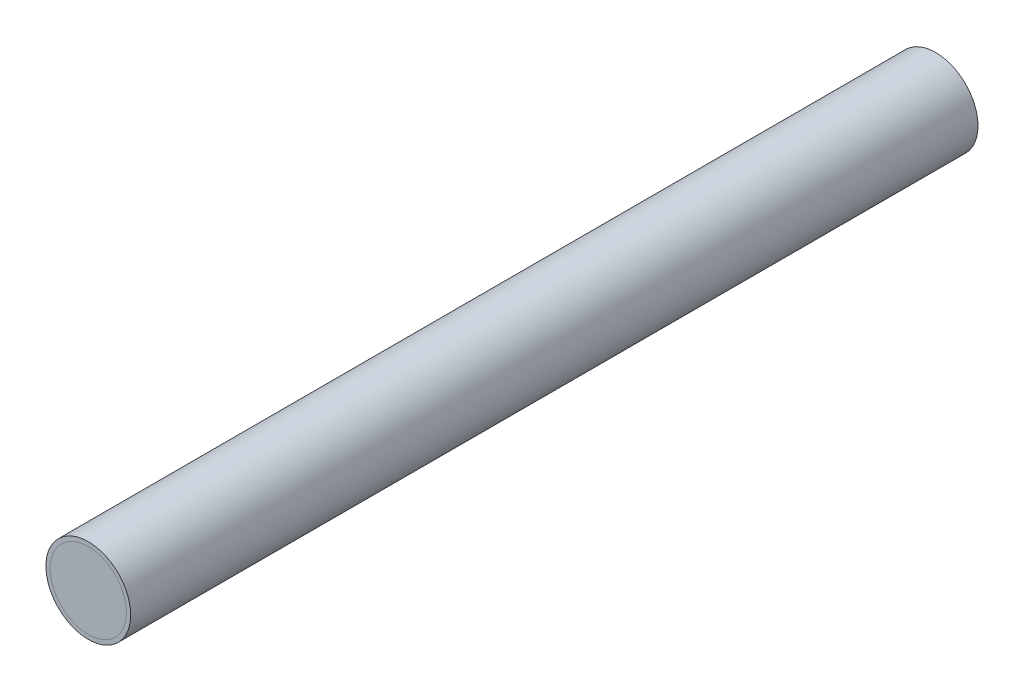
ISO-10303-21;
HEADER;
FILE_DESCRIPTION(('STEP AP214'),'2;1');
FILE_NAME('part.step','',(''),(''),'','','');
FILE_SCHEMA(('AUTOMOTIVE_DESIGN { 1 0 10303 214 1 1 1 1 }'));
ENDSEC;
DATA;
#1=APPLICATION_CONTEXT('core data for automotive mechanical design processes');
#2=APPLICATION_PROTOCOL_DEFINITION('international standard','automotive_design',2000,#1);
#3=PRODUCT_CONTEXT('',#1,'mechanical');
#4=PRODUCT('Part','Part','',(#3));
#5=PRODUCT_RELATED_PRODUCT_CATEGORY('part','',(#4));
#6=PRODUCT_DEFINITION_FORMATION('','',#4);
#7=PRODUCT_DEFINITION_CONTEXT('part definition',#1,'design');
#8=PRODUCT_DEFINITION('design','',#6,#7);
#9=PRODUCT_DEFINITION_SHAPE('','',#8);
#10=(LENGTH_UNIT() NAMED_UNIT(*) SI_UNIT(.MILLI.,.METRE.));
#11=(NAMED_UNIT(*) PLANE_ANGLE_UNIT() SI_UNIT($,.RADIAN.));
#12=(NAMED_UNIT(*) SI_UNIT($,.STERADIAN.) SOLID_ANGLE_UNIT());
#13=UNCERTAINTY_MEASURE_WITH_UNIT(LENGTH_MEASURE(1.E-05),#10,'distance_accuracy_value','');
#14=(GEOMETRIC_REPRESENTATION_CONTEXT(3) GLOBAL_UNCERTAINTY_ASSIGNED_CONTEXT((#13)) GLOBAL_UNIT_ASSIGNED_CONTEXT((#10,
#11,#12)) REPRESENTATION_CONTEXT('',''));
#15=CARTESIAN_POINT('',(0.,0.,0.));
#16=DIRECTION('',(0.,0.,1.));
#17=DIRECTION('',(1.,0.,0.));
#18=AXIS2_PLACEMENT_3D('',#15,#16,#17);
#19=CARTESIAN_POINT('',(0.,0.,1000.));
#20=DIRECTION('',(0.,0.,-1.));
#21=DIRECTION('',(-1.,0.,0.));
#22=AXIS2_PLACEMENT_3D('',#19,#20,#21);
#23=CYLINDRICAL_SURFACE('',#22,50.);
#24=CARTESIAN_POINT('',(0.,0.,1000.));
#25=DIRECTION('',(0.,0.,1.));
#26=DIRECTION('',(1.,0.,0.));
#27=AXIS2_PLACEMENT_3D('',#24,#25,#26);
#28=CIRCLE('',#27,50.);
#29=CARTESIAN_POINT('',(50.,0.,1000.));
#30=VERTEX_POINT('',#29);
#31=EDGE_CURVE('P0_E63',#30,#30,#28,.T.);
#32=ORIENTED_EDGE('',*,*,#31,.F.);
#33=EDGE_LOOP('',(#32));
#34=FACE_BOUND('',#33,.T.);
#35=CARTESIAN_POINT('',(0.,0.,0.));
#36=DIRECTION('',(0.,0.,1.));
#37=DIRECTION('',(1.,0.,0.));
#38=AXIS2_PLACEMENT_3D('',#35,#36,#37);
#39=CIRCLE('',#38,50.);
#40=CARTESIAN_POINT('',(50.,0.,0.));
#41=VERTEX_POINT('',#40);
#42=EDGE_CURVE('P0_E64',#41,#41,#39,.T.);
#43=ORIENTED_EDGE('',*,*,#42,.T.);
#44=EDGE_LOOP('',(#43));
#45=FACE_BOUND('',#44,.T.);
#46=ADVANCED_FACE('P0_F37',(#34,#45),#23,.T.);
#47=CARTESIAN_POINT('',(0.,0.,1000.));
#48=DIRECTION('',(0.,0.,1.));
#49=DIRECTION('',(1.,0.,0.));
#50=AXIS2_PLACEMENT_3D('',#47,#48,#49);
#51=PLANE('',#50);
#52=CARTESIAN_POINT('',(0.,0.,1000.));
#53=DIRECTION('',(0.,0.,1.));
#54=DIRECTION('',(1.,0.,0.));
#55=AXIS2_PLACEMENT_3D('',#52,#53,#54);
#56=CIRCLE('',#55,45.);
#57=CARTESIAN_POINT('',(45.,0.,1000.));
#58=VERTEX_POINT('',#57);
#59=EDGE_CURVE('P0_E67',#58,#58,#56,.T.);
#60=ORIENTED_EDGE('',*,*,#59,.F.);
#61=EDGE_LOOP('',(#60));
#62=FACE_BOUND('',#61,.T.);
#63=ORIENTED_EDGE('',*,*,#31,.T.);
#64=EDGE_LOOP('',(#63));
#65=FACE_BOUND('',#64,.T.);
#66=ADVANCED_FACE('P0_F82',(#62,#65),#51,.T.);
#67=CARTESIAN_POINT('',(0.,0.,0.));
#68=DIRECTION('',(0.,0.,1.));
#69=DIRECTION('',(1.,0.,0.));
#70=AXIS2_PLACEMENT_3D('',#67,#68,#69);
#71=PLANE('',#70);
#72=CARTESIAN_POINT('',(0.,0.,0.));
#73=DIRECTION('',(0.,0.,-1.));
#74=DIRECTION('',(-1.,0.,0.));
#75=AXIS2_PLACEMENT_3D('',#72,#73,#74);
#76=CIRCLE('',#75,45.);
#77=CARTESIAN_POINT('',(-45.,0.,0.));
#78=VERTEX_POINT('',#77);
#79=EDGE_CURVE('P0_E72',#78,#78,#76,.T.);
#80=ORIENTED_EDGE('',*,*,#79,.F.);
#81=EDGE_LOOP('',(#80));
#82=FACE_BOUND('',#81,.T.);
#83=ORIENTED_EDGE('',*,*,#42,.F.);
#84=EDGE_LOOP('',(#83));
#85=FACE_BOUND('',#84,.T.);
#86=ADVANCED_FACE('P0_F78',(#82,#85),#71,.F.);
#87=CARTESIAN_POINT('',(0.,0.,600.));
#88=DIRECTION('',(0.,0.,1.));
#89=DIRECTION('',(1.,0.,0.));
#90=AXIS2_PLACEMENT_3D('',#87,#88,#89);
#91=CYLINDRICAL_SURFACE('',#90,45.);
#92=CARTESIAN_POINT('',(0.,0.,608.660254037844));
#93=DIRECTION('',(0.,0.,-1.));
#94=DIRECTION('',(-1.,0.,0.));
#95=AXIS2_PLACEMENT_3D('',#92,#93,#94);
#96=CIRCLE('',#95,45.);
#97=CARTESIAN_POINT('',(-45.,0.,608.660254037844));
#98=VERTEX_POINT('',#97);
#99=EDGE_CURVE('P0_E10',#98,#98,#96,.T.);
#100=ORIENTED_EDGE('',*,*,#99,.T.);
#101=EDGE_LOOP('',(#100));
#102=FACE_BOUND('',#101,.T.);
#103=ORIENTED_EDGE('',*,*,#59,.T.);
#104=EDGE_LOOP('',(#103));
#105=FACE_BOUND('',#104,.T.);
#106=ADVANCED_FACE('P0_F81',(#102,#105),#91,.F.);
#107=CARTESIAN_POINT('',(0.,0.,400.));
#108=DIRECTION('',(0.,0.,-1.));
#109=DIRECTION('',(-1.,0.,0.));
#110=AXIS2_PLACEMENT_3D('',#107,#108,#109);
#111=CYLINDRICAL_SURFACE('',#110,45.);
#112=CARTESIAN_POINT('',(0.,0.,391.339745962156));
#113=DIRECTION('',(0.,0.,1.));
#114=DIRECTION('',(1.,0.,0.));
#115=AXIS2_PLACEMENT_3D('',#112,#113,#114);
#116=CIRCLE('',#115,45.);
#117=CARTESIAN_POINT('',(45.,0.,391.339745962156));
#118=VERTEX_POINT('',#117);
#119=EDGE_CURVE('P0_E44',#118,#118,#116,.T.);
#120=ORIENTED_EDGE('',*,*,#119,.T.);
#121=EDGE_LOOP('',(#120));
#122=FACE_BOUND('',#121,.T.);
#123=ORIENTED_EDGE('',*,*,#79,.T.);
#124=EDGE_LOOP('',(#123));
#125=FACE_BOUND('',#124,.T.);
#126=ADVANCED_FACE('P0_F76',(#122,#125),#111,.F.);
#127=CARTESIAN_POINT('',(0.,0.,570.));
#128=DIRECTION('',(0.,0.,1.));
#129=DIRECTION('',(1.,0.,0.));
#130=AXIS2_PLACEMENT_3D('',#127,#128,#129);
#131=CONICAL_SURFACE('',#130,9.99999999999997,0.785398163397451);
#132=CARTESIAN_POINT('',(0.,0.,573.701718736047));
#133=DIRECTION('',(0.,0.,-1.));
#134=DIRECTION('',(-1.,0.,0.));
#135=AXIS2_PLACEMENT_3D('',#132,#133,#134);
#136=CIRCLE('',#135,13.7017187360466);
#137=CARTESIAN_POINT('',(-13.7017187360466,0.,573.701718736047));
#138=VERTEX_POINT('',#137);
#139=EDGE_CURVE('P0_E52',#138,#138,#136,.T.);
#140=ORIENTED_EDGE('',*,*,#139,.T.);
#141=EDGE_LOOP('',(#140));
#142=FACE_BOUND('',#141,.T.);
#143=CARTESIAN_POINT('',(0.,0.,600.));
#144=DIRECTION('',(0.,0.,1.));
#145=DIRECTION('',(1.,0.,0.));
#146=AXIS2_PLACEMENT_3D('',#143,#144,#145);
#147=CIRCLE('',#146,39.9999999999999);
#148=CARTESIAN_POINT('',(39.9999999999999,0.,600.));
#149=VERTEX_POINT('',#148);
#150=EDGE_CURVE('P0_E60',#149,#149,#147,.F.);
#151=ORIENTED_EDGE('',*,*,#150,.F.);
#152=EDGE_LOOP('',(#151));
#153=FACE_BOUND('',#152,.T.);
#154=ADVANCED_FACE('P0_F96',(#142,#153),#131,.F.);
#155=CARTESIAN_POINT('',(0.,0.,570.138454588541));
#156=DIRECTION('',(0.,0.,-1.));
#157=DIRECTION('',(-1.,0.,0.));
#158=AXIS2_PLACEMENT_3D('',#155,#156,#157);
#159=CONICAL_SURFACE('',#158,9.99999999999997,0.17453292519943);
#160=CARTESIAN_POINT('',(0.,0.,564.894169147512));
#161=DIRECTION('',(0.,0.,1.));
#162=DIRECTION('',(1.,0.,0.));
#163=AXIS2_PLACEMENT_3D('',#160,#161,#162);
#164=CIRCLE('',#163,10.92470901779);
#165=CARTESIAN_POINT('',(-10.92470901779,0.,564.894169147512));
#166=VERTEX_POINT('',#165);
#167=EDGE_CURVE('P0_E48',#166,#166,#164,.T.);
#168=CARTESIAN_POINT('',(0.,0.,400.));
#169=DIRECTION('',(0.,0.,-1.));
#170=DIRECTION('',(-1.,0.,0.));
#171=AXIS2_PLACEMENT_3D('',#168,#169,#170);
#172=CIRCLE('',#171,40.0000000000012);
#173=CARTESIAN_POINT('',(-40.0000000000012,0.,400.));
#174=VERTEX_POINT('',#173);
#175=EDGE_CURVE('P0_E57',#174,#174,#172,.F.);
#176=CARTESIAN_POINT('',(-10.92470901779,0.,564.894169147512));
#177=CARTESIAN_POINT('',(-11.227576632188,0.,563.176521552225));
#178=CARTESIAN_POINT('',(-11.530444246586,0.,561.458873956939));
#179=CARTESIAN_POINT('',(-12.1361794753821,0.,558.023578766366));
#180=CARTESIAN_POINT('',(-12.4390470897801,0.,556.305931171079));
#181=CARTESIAN_POINT('',(-13.0447823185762,0.,552.870635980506));
#182=CARTESIAN_POINT('',(-13.3476499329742,0.,551.152988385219));
#183=CARTESIAN_POINT('',(-13.9533851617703,0.,547.717693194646));
#184=CARTESIAN_POINT('',(-14.2562527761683,0.,546.00004559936));
#185=CARTESIAN_POINT('',(-14.8619880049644,0.,542.564750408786));
#186=CARTESIAN_POINT('',(-15.1648556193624,0.,540.8471028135));
#187=CARTESIAN_POINT('',(-15.7705908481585,0.,537.411807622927));
#188=CARTESIAN_POINT('',(-16.0734584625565,0.,535.69416002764));
#189=CARTESIAN_POINT('',(-16.6791936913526,0.,532.258864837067));
#190=CARTESIAN_POINT('',(-16.9820613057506,0.,530.54121724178));
#191=CARTESIAN_POINT('',(-17.5877965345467,0.,527.105922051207));
#192=CARTESIAN_POINT('',(-17.8906641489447,0.,525.388274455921));
#193=CARTESIAN_POINT('',(-18.4963993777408,0.,521.952979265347));
#194=CARTESIAN_POINT('',(-18.7992669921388,0.,520.235331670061));
#195=CARTESIAN_POINT('',(-19.4050022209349,0.,516.800036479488));
#196=CARTESIAN_POINT('',(-19.7078698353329,0.,515.082388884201));
#197=CARTESIAN_POINT('',(-20.313605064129,0.,511.647093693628));
#198=CARTESIAN_POINT('',(-20.616472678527,0.,509.929446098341));
#199=CARTESIAN_POINT('',(-21.2222079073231,0.,506.494150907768));
#200=CARTESIAN_POINT('',(-21.5250755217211,0.,504.776503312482));
#201=CARTESIAN_POINT('',(-22.1308107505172,0.,501.341208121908));
#202=CARTESIAN_POINT('',(-22.4336783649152,0.,499.623560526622));
#203=CARTESIAN_POINT('',(-23.0394135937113,0.,496.188265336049));
#204=CARTESIAN_POINT('',(-23.3422812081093,0.,494.470617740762));
#205=CARTESIAN_POINT('',(-23.9480164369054,0.,491.035322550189));
#206=CARTESIAN_POINT('',(-24.2508840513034,0.,489.317674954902));
#207=CARTESIAN_POINT('',(-24.8566192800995,0.,485.882379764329));
#208=CARTESIAN_POINT('',(-25.1594868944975,0.,484.164732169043));
#209=CARTESIAN_POINT('',(-25.7652221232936,0.,480.729436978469));
#210=CARTESIAN_POINT('',(-26.0680897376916,0.,479.011789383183));
#211=CARTESIAN_POINT('',(-26.6738249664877,0.,475.57649419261));
#212=CARTESIAN_POINT('',(-26.9766925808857,0.,473.858846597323));
#213=CARTESIAN_POINT('',(-27.5824278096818,0.,470.42355140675));
#214=CARTESIAN_POINT('',(-27.8852954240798,0.,468.705903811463));
#215=CARTESIAN_POINT('',(-28.4910306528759,0.,465.27060862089));
#216=CARTESIAN_POINT('',(-28.7938982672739,0.,463.552961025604));
#217=CARTESIAN_POINT('',(-29.39963349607,0.,460.11766583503));
#218=CARTESIAN_POINT('',(-29.702501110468,0.,458.400018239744));
#219=CARTESIAN_POINT('',(-30.3082363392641,0.,454.964723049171));
#220=CARTESIAN_POINT('',(-30.6111039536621,0.,453.247075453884));
#221=CARTESIAN_POINT('',(-31.2168391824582,0.,449.811780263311));
#222=CARTESIAN_POINT('',(-31.5197067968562,0.,448.094132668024));
#223=CARTESIAN_POINT('',(-32.1254420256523,0.,444.658837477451));
#224=CARTESIAN_POINT('',(-32.4283096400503,0.,442.941189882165));
#225=CARTESIAN_POINT('',(-33.0340448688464,0.,439.505894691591));
#226=CARTESIAN_POINT('',(-33.3369124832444,0.,437.788247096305));
#227=CARTESIAN_POINT('',(-33.9426477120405,0.,434.352951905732));
#228=CARTESIAN_POINT('',(-34.2455153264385,0.,432.635304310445));
#229=CARTESIAN_POINT('',(-34.8512505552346,0.,429.200009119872));
#230=CARTESIAN_POINT('',(-35.1541181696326,0.,427.482361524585));
#231=CARTESIAN_POINT('',(-35.7598533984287,0.,424.047066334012));
#232=CARTESIAN_POINT('',(-36.0627210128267,0.,422.329418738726));
#233=CARTESIAN_POINT('',(-36.6684562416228,0.,418.894123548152));
#234=CARTESIAN_POINT('',(-36.9713238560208,0.,417.176475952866));
#235=CARTESIAN_POINT('',(-37.5770590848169,0.,413.741180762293));
#236=CARTESIAN_POINT('',(-37.8799266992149,0.,412.023533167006));
#237=CARTESIAN_POINT('',(-38.485661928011,0.,408.588237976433));
#238=CARTESIAN_POINT('',(-38.788529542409,0.,406.870590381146));
#239=CARTESIAN_POINT('',(-39.3942647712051,0.,403.435295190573));
#240=CARTESIAN_POINT('',(-39.6971323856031,0.,401.717647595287));
#241=CARTESIAN_POINT('',(-40.0000000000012,0.,400.));
#242=B_SPLINE_CURVE_WITH_KNOTS('',3,(#176,#177,#178,#179,#180,#181,#182,#183,#184,#185,#186,
#187,#188,#189,#190,#191,#192,#193,#194,#195,#196,#197,#198,#199,#200,#201,#202,#203,#204,#205,
#206,#207,#208,#209,#210,#211,#212,#213,#214,#215,#216,#217,#218,#219,#220,#221,#222,#223,#224,
#225,#226,#227,#228,#229,#230,#231,#232,#233,#234,#235,#236,#237,#238,#239,#240,#241),
.UNSPECIFIED.,.F.,.F.,(4,2,2,2,2,2,2,2,2,2,2,2,2,2,2,2,2,2,2,2,2,2,2,2,2,2,2,2,2,2,2,2,4),(0.,
5.23243523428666,10.4648704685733,15.69730570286,20.9297409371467,26.1621761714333,
31.39461140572,36.6270466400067,41.8594818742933,47.0919171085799,52.3243523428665,
57.5567875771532,62.7892228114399,68.0216580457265,73.2540932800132,78.4865285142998,
83.7189637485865,88.9513989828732,94.1838342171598,99.4162694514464,104.648704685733,
109.88113992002,115.113575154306,120.346010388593,125.57844562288,130.810880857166,
136.043316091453,141.27575132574,146.508186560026,151.740621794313,156.9730570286,
162.205492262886,167.437927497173),.UNSPECIFIED.);
#243=EDGE_CURVE('P0_BSEAM99',#166,#174,#242,.T.);
#244=ORIENTED_EDGE('',*,*,#167,.T.);
#245=ORIENTED_EDGE('',*,*,#175,.F.);
#246=ORIENTED_EDGE('',*,*,#243,.T.);
#247=ORIENTED_EDGE('',*,*,#243,.F.);
#248=EDGE_LOOP('',(#244,#246,#245,#247));
#249=FACE_BOUND('',#248,.T.);
#250=ADVANCED_FACE('P0_F99',(#249),#159,.F.);
#251=CARTESIAN_POINT('',(0.,0.,566.630650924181));
#252=DIRECTION('',(0.,0.,1.));
#253=DIRECTION('',(1.,0.,0.));
#254=AXIS2_PLACEMENT_3D('',#251,#252,#253);
#255=TOROIDAL_SURFACE('',#254,20.7727865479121,10.);
#256=ORIENTED_EDGE('',*,*,#167,.F.);
#257=EDGE_LOOP('',(#256));
#258=FACE_BOUND('',#257,.T.);
#259=ORIENTED_EDGE('',*,*,#139,.F.);
#260=EDGE_LOOP('',(#259));
#261=FACE_BOUND('',#260,.T.);
#262=ADVANCED_FACE('P0_F103',(#258,#261),#255,.T.);
#263=CARTESIAN_POINT('',(0.,0.,391.339745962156));
#264=DIRECTION('',(0.,0.,1.));
#265=DIRECTION('',(1.,0.,0.));
#266=AXIS2_PLACEMENT_3D('',#263,#264,#265);
#267=TOROIDAL_SURFACE('',#266,35.,10.);
#268=ORIENTED_EDGE('',*,*,#119,.F.);
#269=EDGE_LOOP('',(#268));
#270=FACE_BOUND('',#269,.T.);
#271=ORIENTED_EDGE('',*,*,#175,.T.);
#272=EDGE_LOOP('',(#271));
#273=FACE_BOUND('',#272,.T.);
#274=ADVANCED_FACE('P0_F106',(#270,#273),#267,.F.);
#275=CARTESIAN_POINT('',(0.,0.,608.660254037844));
#276=DIRECTION('',(0.,0.,-1.));
#277=DIRECTION('',(-1.,0.,0.));
#278=AXIS2_PLACEMENT_3D('',#275,#276,#277);
#279=TOROIDAL_SURFACE('',#278,35.,10.);
#280=ORIENTED_EDGE('',*,*,#99,.F.);
#281=EDGE_LOOP('',(#280));
#282=FACE_BOUND('',#281,.T.);
#283=ORIENTED_EDGE('',*,*,#150,.T.);
#284=EDGE_LOOP('',(#283));
#285=FACE_BOUND('',#284,.T.);
#286=ADVANCED_FACE('P0_F39',(#282,#285),#279,.F.);
#287=CLOSED_SHELL('',(#46,#66,#86,#106,#126,#154,#250,#262,#274,#286));
#288=MANIFOLD_SOLID_BREP('P0_B2',#287);
#289=CARTESIAN_POINT('',(46.2727922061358,0.,994.949247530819));
#290=CARTESIAN_POINT('',(46.2727849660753,1.51426166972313,994.949247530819));
#291=CARTESIAN_POINT('',(46.1250616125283,4.54287506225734,994.949247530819));
#292=CARTESIAN_POINT('',(45.4561414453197,9.0416480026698,994.949247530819));
#293=CARTESIAN_POINT('',(44.3525434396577,13.4541001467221,994.949247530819));
#294=CARTESIAN_POINT('',(42.8187891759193,17.7359285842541,994.949247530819));
#295=CARTESIAN_POINT('',(40.8755581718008,21.8483404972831,994.949247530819));
#296=CARTESIAN_POINT('',(38.535925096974,25.7486759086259,994.949247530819));
#297=CARTESIAN_POINT('',(35.827741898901,29.4029585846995,994.949247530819));
#298=CARTESIAN_POINT('',(32.7721478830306,32.7719115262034,994.949247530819));
#299=CARTESIAN_POINT('',(29.4030891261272,35.8276345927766,994.949247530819));
#300=CARTESIAN_POINT('',(25.748957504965,38.5357373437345,994.949247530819));
#301=CARTESIAN_POINT('',(21.8484922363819,40.8754747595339,994.949247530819));
#302=CARTESIAN_POINT('',(17.7362491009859,42.8186563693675,994.949247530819));
#303=CARTESIAN_POINT('',(13.454270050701,44.3524933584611,994.949247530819));
#304=CARTESIAN_POINT('',(9.04194658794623,45.4560784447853,994.949247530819));
#305=CARTESIAN_POINT('',(4.54300781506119,46.1250705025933,994.949247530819));
#306=CARTESIAN_POINT('',(0.000167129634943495,46.3466489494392,994.949247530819));
#307=CARTESIAN_POINT('',(-4.54283963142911,46.1250869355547,994.949247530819));
#308=CARTESIAN_POINT('',(-9.04161470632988,45.4561447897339,994.949247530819));
#309=CARTESIAN_POINT('',(-13.4541037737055,44.3525417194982,994.949247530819));
#310=CARTESIAN_POINT('',(-17.7359325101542,42.8187875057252,994.949247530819));
#311=CARTESIAN_POINT('',(-21.8483404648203,40.8755581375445,994.949247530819));
#312=CARTESIAN_POINT('',(-25.7486759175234,38.5359251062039,994.949247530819));
#313=CARTESIAN_POINT('',(-29.4029585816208,35.8277418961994,994.949247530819));
#314=CARTESIAN_POINT('',(-32.7719115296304,32.772147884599,994.949247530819));
#315=CARTESIAN_POINT('',(-35.8276345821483,29.4030891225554,994.949247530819));
#316=CARTESIAN_POINT('',(-38.5357373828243,25.748957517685,994.949247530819));
#317=CARTESIAN_POINT('',(-40.8754746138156,21.8484921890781,994.949247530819));
#318=CARTESIAN_POINT('',(-42.8186551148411,17.7362530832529,994.949247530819));
#319=CARTESIAN_POINT('',(-44.3524900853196,13.4542734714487,994.949247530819));
#320=CARTESIAN_POINT('',(-45.4560763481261,9.0419589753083,994.949247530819));
#321=CARTESIAN_POINT('',(-46.1250695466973,4.54301617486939,994.949247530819));
#322=CARTESIAN_POINT('',(-46.3466489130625,0.000183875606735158,994.949247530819));
#323=CARTESIAN_POINT('',(-46.125088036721,-4.54283130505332,994.949247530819));
#324=CARTESIAN_POINT('',(-45.4561457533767,-9.04160634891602,994.949247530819));
#325=CARTESIAN_POINT('',(-44.3525456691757,-13.4541049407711,994.949247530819));
#326=CARTESIAN_POINT('',(-42.8187855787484,-17.7359363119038,994.949247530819));
#327=CARTESIAN_POINT('',(-40.8755544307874,-21.8483431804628,994.949247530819));
#328=CARTESIAN_POINT('',(-38.5359256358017,-25.74867629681,994.949247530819));
#329=CARTESIAN_POINT('',(-35.8277428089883,-29.4029538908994,994.949247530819));
#330=CARTESIAN_POINT('',(-32.7721570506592,-32.7719029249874,994.949247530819));
#331=CARTESIAN_POINT('',(-29.4030955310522,-35.8276291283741,994.949247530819));
#332=CARTESIAN_POINT('',(-25.7489714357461,-38.535728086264,994.949247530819));
#333=CARTESIAN_POINT('',(-21.8484996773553,-40.8754707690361,994.949247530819));
#334=CARTESIAN_POINT('',(-17.7362645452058,-42.8186499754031,994.949247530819));
#335=CARTESIAN_POINT('',(-13.4542781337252,-44.3524909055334,994.949247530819));
#336=CARTESIAN_POINT('',(-9.04196298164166,-45.4560751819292,994.949247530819));
#337=CARTESIAN_POINT('',(-4.54301621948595,-46.1250696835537,994.949247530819));
#338=CARTESIAN_POINT('',(-0.000183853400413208,-46.346648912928,994.949247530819));
#339=CARTESIAN_POINT('',(4.54283126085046,-46.1250879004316,994.949247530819));
#340=CARTESIAN_POINT('',(9.04160234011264,-45.4561469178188,994.949247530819));
#341=CARTESIAN_POINT('',(13.4541002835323,-44.3525448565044,994.949247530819));
#342=CARTESIAN_POINT('',(17.7359248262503,-42.818790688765,994.949247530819));
#343=CARTESIAN_POINT('',(21.8483357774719,-40.8755583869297,994.949247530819));
#344=CARTESIAN_POINT('',(25.7486656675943,-38.5359323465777,994.949247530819));
#345=CARTESIAN_POINT('',(29.4029519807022,-35.82774713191,994.949247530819));
#346=CARTESIAN_POINT('',(32.7718997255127,-32.7721597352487,994.949247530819));
#347=CARTESIAN_POINT('',(35.8276292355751,-29.4030956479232,994.949247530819));
#348=CARTESIAN_POINT('',(38.5357280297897,-25.7489714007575,994.949247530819));
#349=CARTESIAN_POINT('',(40.8754708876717,-21.8484997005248,994.949247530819));
#350=CARTESIAN_POINT('',(42.8186495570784,-17.7362644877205,994.949247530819));
#351=CARTESIAN_POINT('',(44.3524924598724,-13.4542783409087,994.949247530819));
#352=CARTESIAN_POINT('',(45.4560806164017,-9.04191729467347,994.949247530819));
#353=CARTESIAN_POINT('',(46.1250959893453,-4.54297241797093,994.949247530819));
#354=CARTESIAN_POINT('',(46.2727994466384,-1.51435415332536,994.949247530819));
#355=CARTESIAN_POINT('',(46.2727922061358,0.,994.949247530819));
#356=B_SPLINE_CURVE_WITH_KNOTS('',3,(#289,#290,#291,#292,#293,#294,#295,#296,#297,#298,#299,
#300,#301,#302,#303,#304,#305,#306,#307,#308,#309,#310,#311,#312,#313,#314,#315,#316,#317,#318,
#319,#320,#321,#322,#323,#324,#325,#326,#327,#328,#329,#330,#331,#332,#333,#334,#335,#336,#337,
#338,#339,#340,#341,#342,#343,#344,#345,#346,#347,#348,#349,#350,#351,#352,#353,#354,#355),
.UNSPECIFIED.,.T.,.F.,(4,1,1,1,1,1,1,1,1,1,1,1,1,1,1,1,1,1,1,1,1,1,1,1,1,1,1,1,1,1,1,1,1,1,1,1,
1,1,1,1,1,1,1,1,1,1,1,1,1,1,1,1,1,1,1,1,1,1,1,1,1,1,1,1,4),(0.,0.0156245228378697,
0.031249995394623,0.0468740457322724,0.0624999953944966,0.0781240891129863,0.0937499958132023,
0.109374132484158,0.124999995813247,0.140624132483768,0.156249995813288,0.171874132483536,
0.187499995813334,0.203124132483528,0.218749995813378,0.234374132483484,0.249999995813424,
0.265624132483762,0.28124999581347,0.296874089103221,0.312499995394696,0.328124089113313,
0.343749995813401,0.359374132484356,0.374999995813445,0.390624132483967,0.406249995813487,
0.421874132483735,0.437499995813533,0.453124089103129,0.468749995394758,0.484374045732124,
0.499999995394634,0.515624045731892,0.53124999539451,0.546874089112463,0.562499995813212,
0.578124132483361,0.593749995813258,0.609374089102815,0.624999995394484,0.640624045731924,
0.65624999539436,0.671874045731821,0.687499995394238,0.703124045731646,0.718749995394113,
0.734374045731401,0.749999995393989,0.765624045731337,0.781249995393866,0.796874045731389,
0.812499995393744,0.828124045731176,0.843749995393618,0.859374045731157,0.874999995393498,
0.890624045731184,0.906249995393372,0.921874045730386,0.937499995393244,0.953124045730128,
0.968749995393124,0.984374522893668,1.),.UNSPECIFIED.);
#357=DIRECTION('',(0.,0.,1.));
#358=VECTOR('',#357,1.);
#359=SURFACE_OF_LINEAR_EXTRUSION('',#356,#358);
#360=CARTESIAN_POINT('',(46.2727922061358,-8.09570071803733E-09,994.949247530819));
#361=CARTESIAN_POINT('',(46.2727804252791,0.605716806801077,994.949247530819));
#362=CARTESIAN_POINT('',(46.2609651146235,1.21144024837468,994.949247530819));
#363=CARTESIAN_POINT('',(46.2136101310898,2.42194701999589,994.949247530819));
#364=CARTESIAN_POINT('',(46.1780708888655,3.02673036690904,994.949247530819));
#365=CARTESIAN_POINT('',(46.0831513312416,4.23441821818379,994.949247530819));
#366=CARTESIAN_POINT('',(46.0237713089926,4.83732274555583,994.949247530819));
#367=CARTESIAN_POINT('',(45.8812590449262,6.04032378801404,994.949247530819));
#368=CARTESIAN_POINT('',(45.7981265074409,6.64042026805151,994.949247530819));
#369=CARTESIAN_POINT('',(45.608418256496,7.83690492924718,994.949247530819));
#370=CARTESIAN_POINT('',(45.5018421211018,8.43329304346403,994.949247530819));
#371=CARTESIAN_POINT('',(45.2655043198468,9.6214574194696,994.949247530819));
#372=CARTESIAN_POINT('',(45.1357426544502,10.2132336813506,994.949247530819));
#373=CARTESIAN_POINT('',(44.8531397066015,11.3912405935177,994.949247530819));
#374=CARTESIAN_POINT('',(44.7002988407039,11.9774713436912,994.949247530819));
#375=CARTESIAN_POINT('',(44.3715965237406,13.1434369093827,994.949247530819));
#376=CARTESIAN_POINT('',(44.1957353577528,13.7231718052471,994.949247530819));
#377=CARTESIAN_POINT('',(43.8212641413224,14.8752535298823,994.949247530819));
#378=CARTESIAN_POINT('',(43.6226538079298,15.4476002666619,994.949247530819));
#379=CARTESIAN_POINT('',(43.2031640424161,16.5840831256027,994.949247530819));
#380=CARTESIAN_POINT('',(42.9822842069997,17.1482190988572,994.949247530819));
#381=CARTESIAN_POINT('',(42.5186860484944,18.2674452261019,994.949247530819));
#382=CARTESIAN_POINT('',(42.2759677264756,18.8225353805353,994.949247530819));
#383=CARTESIAN_POINT('',(41.768977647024,19.9227743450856,994.949247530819));
#384=CARTESIAN_POINT('',(41.5047062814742,20.4679233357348,994.949247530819));
#385=CARTESIAN_POINT('',(40.9548523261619,21.5473589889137,994.949247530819));
#386=CARTESIAN_POINT('',(40.6692700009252,22.0816457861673,994.949247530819));
#387=CARTESIAN_POINT('',(40.0772343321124,23.1385349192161,994.949247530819));
#388=CARTESIAN_POINT('',(39.7707807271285,23.6611371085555,994.949247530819));
#389=CARTESIAN_POINT('',(39.137633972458,24.693944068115,994.949247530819));
#390=CARTESIAN_POINT('',(38.8109404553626,25.2041486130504,994.949247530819));
#391=CARTESIAN_POINT('',(38.1378994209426,26.2114252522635,994.949247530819));
#392=CARTESIAN_POINT('',(37.7915519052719,26.7084973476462,994.949247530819));
#393=CARTESIAN_POINT('',(37.0796571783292,27.6886864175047,994.949247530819));
#394=CARTESIAN_POINT('',(36.714110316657,28.1718036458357,994.949247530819));
#395=CARTESIAN_POINT('',(35.9642341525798,29.1232270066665,994.949247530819));
#396=CARTESIAN_POINT('',(35.5799050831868,29.5915333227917,994.949247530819));
#397=CARTESIAN_POINT('',(34.7930565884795,30.5126143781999,994.949247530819));
#398=CARTESIAN_POINT('',(34.3905369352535,30.9653889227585,994.949247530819));
#399=CARTESIAN_POINT('',(33.5680655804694,31.8548302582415,994.949247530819));
#400=CARTESIAN_POINT('',(33.1481135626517,32.2914967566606,994.949247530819));
#401=CARTESIAN_POINT('',(32.2914950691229,33.1481152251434,994.949247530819));
#402=CARTESIAN_POINT('',(31.8548285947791,33.5680671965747,994.949247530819));
#403=CARTESIAN_POINT('',(30.9653873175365,34.3905384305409,994.949247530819));
#404=CARTESIAN_POINT('',(30.5126128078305,34.793058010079,994.949247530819));
#405=CARTESIAN_POINT('',(29.591531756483,35.579906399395,994.949247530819));
#406=CARTESIAN_POINT('',(29.1232254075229,35.9642354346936,994.949247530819));
#407=CARTESIAN_POINT('',(28.1718019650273,36.7141116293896,994.949247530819));
#408=CARTESIAN_POINT('',(27.6886846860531,37.0796585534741,994.949247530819));
#409=CARTESIAN_POINT('',(26.7084955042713,37.7915533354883,994.949247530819));
#410=CARTESIAN_POINT('',(26.2114233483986,38.1379008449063,994.949247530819));
#411=CARTESIAN_POINT('',(25.2041465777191,38.8109416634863,994.949247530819));
#412=CARTESIAN_POINT('',(24.6939419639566,39.1376349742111,994.949247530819));
#413=CARTESIAN_POINT('',(23.6611348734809,39.7707812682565,994.949247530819));
#414=CARTESIAN_POINT('',(23.1385326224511,40.0772346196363,994.949247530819));
#415=CARTESIAN_POINT('',(22.0816433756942,40.6692699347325,994.949247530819));
#416=CARTESIAN_POINT('',(21.5473565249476,40.9548521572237,994.949247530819));
#417=CARTESIAN_POINT('',(20.4679208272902,41.504706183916,994.949247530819));
#418=CARTESIAN_POINT('',(19.9227718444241,41.7689777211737,994.949247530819));
#419=CARTESIAN_POINT('',(18.8225329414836,42.2759682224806,994.949247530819));
#420=CARTESIAN_POINT('',(18.2674428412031,42.5186867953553,994.949247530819));
#421=CARTESIAN_POINT('',(17.1482168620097,42.9822853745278,994.949247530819));
#422=CARTESIAN_POINT('',(16.5840809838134,43.2031653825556,994.949247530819));
#423=CARTESIAN_POINT('',(15.447598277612,43.6226552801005,994.949247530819));
#424=CARTESIAN_POINT('',(14.8752515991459,43.8212655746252,994.949247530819));
#425=CARTESIAN_POINT('',(13.7231698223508,44.1957362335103,994.949247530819));
#426=CARTESIAN_POINT('',(13.143434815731,44.3715968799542,994.949247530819));
#427=CARTESIAN_POINT('',(11.9774689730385,44.7002981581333,994.949247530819));
#428=CARTESIAN_POINT('',(11.3912380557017,44.8531385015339,994.949247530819));
#429=CARTESIAN_POINT('',(10.2132309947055,45.1357413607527,994.949247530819));
#430=CARTESIAN_POINT('',(9.62145475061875,45.2655034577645,994.949247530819));
#431=CARTESIAN_POINT('',(8.4332907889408,45.5018439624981,994.949247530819));
#432=CARTESIAN_POINT('',(7.83690307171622,45.6084223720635,994.949247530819));
#433=CARTESIAN_POINT('',(6.6404191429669,45.7981351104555,994.949247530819));
#434=CARTESIAN_POINT('',(6.04032299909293,45.8812698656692,994.949247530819));
#435=CARTESIAN_POINT('',(4.83732254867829,46.0237851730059,994.949247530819));
#436=CARTESIAN_POINT('',(4.23441827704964,46.083166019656,994.949247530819));
#437=CARTESIAN_POINT('',(3.02672970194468,46.1780827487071,994.949247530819));
#438=CARTESIAN_POINT('',(2.42194537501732,46.2136183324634,994.949247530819));
#439=CARTESIAN_POINT('',(1.21144030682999,46.2609732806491,994.949247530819));
#440=CARTESIAN_POINT('',(0.605719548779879,46.2727922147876,994.949247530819));
#441=CARTESIAN_POINT('',(-0.605721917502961,46.272792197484,994.949247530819));
#442=CARTESIAN_POINT('',(-1.21144262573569,46.2609732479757,994.949247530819));
#443=CARTESIAN_POINT('',(-2.42194756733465,46.2136182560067,994.949247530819));
#444=CARTESIAN_POINT('',(-3.02673181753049,46.1780826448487,994.949247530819));
#445=CARTESIAN_POINT('',(-4.2344203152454,46.0831658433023,994.949247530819));
#446=CARTESIAN_POINT('',(-4.83732458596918,46.0237849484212,994.949247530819));
#447=CARTESIAN_POINT('',(-6.04032511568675,45.8812696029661,994.949247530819));
#448=CARTESIAN_POINT('',(-6.64042133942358,45.798134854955,994.949247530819));
#449=CARTESIAN_POINT('',(-7.83690538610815,45.6084220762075,994.949247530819));
#450=CARTESIAN_POINT('',(-8.43329314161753,45.5018436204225,994.949247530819));
#451=CARTESIAN_POINT('',(-9.62145704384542,45.265502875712,994.949247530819));
#452=CARTESIAN_POINT('',(-10.2132331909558,45.1357405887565,994.949247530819));
#453=CARTESIAN_POINT('',(-11.3912400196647,44.8531373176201,994.949247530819));
#454=CARTESIAN_POINT('',(-11.9774708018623,44.7002967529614,994.949247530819));
#455=CARTESIAN_POINT('',(-13.1434364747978,44.3715951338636,994.949247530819));
#456=CARTESIAN_POINT('',(-13.7231714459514,44.1957343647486,994.949247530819));
#457=CARTESIAN_POINT('',(-14.8752533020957,43.8212636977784,994.949247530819));
#458=CARTESIAN_POINT('',(-15.4476000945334,43.6226535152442,994.949247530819));
#459=CARTESIAN_POINT('',(-16.5840830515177,43.2031639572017,994.949247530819));
#460=CARTESIAN_POINT('',(-17.1482190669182,42.9822841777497,994.949247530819));
#461=CARTESIAN_POINT('',(-18.26744524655,42.5186860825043,994.949247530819));
#462=CARTESIAN_POINT('',(-18.8225354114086,42.2759677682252,994.949247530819));
#463=CARTESIAN_POINT('',(-19.9227743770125,41.7689776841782,994.949247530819));
#464=CARTESIAN_POINT('',(-20.4679233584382,41.5047063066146,994.949247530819));
#465=CARTESIAN_POINT('',(-21.5473589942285,40.954852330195,994.949247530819));
#466=CARTESIAN_POINT('',(-22.0816457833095,40.6692699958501,994.949247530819));
#467=CARTESIAN_POINT('',(-23.1385349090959,40.0772343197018,994.949247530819));
#468=CARTESIAN_POINT('',(-23.661137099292,39.7707807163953,994.949247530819));
#469=CARTESIAN_POINT('',(-24.6939440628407,39.1376339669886,994.949247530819));
#470=CARTESIAN_POINT('',(-25.2041486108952,38.8109404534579,994.949247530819));
#471=CARTESIAN_POINT('',(-26.2114252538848,38.137899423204,994.949247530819));
#472=CARTESIAN_POINT('',(-26.7084973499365,37.7915519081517,994.949247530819));
#473=CARTESIAN_POINT('',(-27.6886864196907,37.0796571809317,994.949247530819));
#474=CARTESIAN_POINT('',(-28.1718036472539,36.7141103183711,994.949247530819));
#475=CARTESIAN_POINT('',(-29.1232270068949,35.9642341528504,994.949247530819));
#476=CARTESIAN_POINT('',(-29.5915333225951,35.5799050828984,994.949247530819));
#477=CARTESIAN_POINT('',(-30.5126143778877,34.7930565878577,994.949247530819));
#478=CARTESIAN_POINT('',(-30.9653889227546,34.3905369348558,994.949247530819));
#479=CARTESIAN_POINT('',(-31.8548302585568,33.5680655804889,994.949247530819));
#480=CARTESIAN_POINT('',(-32.2914967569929,33.1481135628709,994.949247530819));
#481=CARTESIAN_POINT('',(-33.1481152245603,32.2914950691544,994.949247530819));
#482=CARTESIAN_POINT('',(-33.5680671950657,31.85482859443,994.949247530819));
#483=CARTESIAN_POINT('',(-34.390538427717,30.9653873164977,994.949247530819));
#484=CARTESIAN_POINT('',(-34.7930580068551,30.5126128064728,994.949247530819));
#485=CARTESIAN_POINT('',(-35.5799063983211,29.5915317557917,994.949247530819));
#486=CARTESIAN_POINT('',(-35.9642354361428,29.1232254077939,994.949247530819));
#487=CARTESIAN_POINT('',(-36.7141116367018,28.1718019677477,994.949247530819));
#488=CARTESIAN_POINT('',(-37.0796585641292,27.6886846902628,994.949247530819));
#489=CARTESIAN_POINT('',(-37.7915533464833,26.7084955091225,994.949247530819));
#490=CARTESIAN_POINT('',(-38.1379008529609,26.2114233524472,994.949247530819));
#491=CARTESIAN_POINT('',(-38.8109416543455,25.2041465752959,994.949247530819));
#492=CARTESIAN_POINT('',(-39.1376349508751,24.693941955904,994.949247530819));
#493=CARTESIAN_POINT('',(-39.770781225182,23.6611348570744,994.949247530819));
#494=CARTESIAN_POINT('',(-40.0772345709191,23.1385326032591,994.949247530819));
#495=CARTESIAN_POINT('',(-40.669269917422,22.0816433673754,994.949247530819));
#496=CARTESIAN_POINT('',(-40.9548521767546,21.5473565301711,994.949247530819));
#497=CARTESIAN_POINT('',(-41.5047062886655,20.4679208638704,994.949247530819));
#498=CARTESIAN_POINT('',(-41.7689778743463,19.922771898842,994.949247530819));
#499=CARTESIAN_POINT('',(-42.2759683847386,18.8225330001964,994.949247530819));
#500=CARTESIAN_POINT('',(-42.5186869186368,18.2674428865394,994.949247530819));
#501=CARTESIAN_POINT('',(-42.9822852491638,17.1482168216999,994.949247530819));
#502=CARTESIAN_POINT('',(-43.2031650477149,16.5840808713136,994.949247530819));
#503=CARTESIAN_POINT('',(-43.6226545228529,15.4475980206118,994.949247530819));
#504=CARTESIAN_POINT('',(-43.8212646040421,14.8752512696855,994.949247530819));
#505=CARTESIAN_POINT('',(-44.19573504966,13.7231694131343,994.949247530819));
#506=CARTESIAN_POINT('',(-44.3715956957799,13.1434343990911,994.949247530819));
#507=CARTESIAN_POINT('',(-44.7002971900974,11.9774686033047,994.949247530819));
#508=CARTESIAN_POINT('',(-44.8531377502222,11.391237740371,994.949247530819));
#509=CARTESIAN_POINT('',(-45.1357410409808,10.2132307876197,994.949247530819));
#510=CARTESIAN_POINT('',(-45.2655033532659,9.62145459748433,994.949247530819));
#511=CARTESIAN_POINT('',(-45.5018441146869,8.43329070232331,994.949247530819));
#512=CARTESIAN_POINT('',(-45.608422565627,7.83690299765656,994.949247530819));
#513=CARTESIAN_POINT('',(-45.7981352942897,6.64041907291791,994.949247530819));
#514=CARTESIAN_POINT('',(-45.8812699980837,6.04032292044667,994.949247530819));
#515=CARTESIAN_POINT('',(-46.0237852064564,4.83732245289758,994.949247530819));
#516=CARTESIAN_POINT('',(-46.0831660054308,4.23441817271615,994.949247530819));
#517=CARTESIAN_POINT('',(-46.1780826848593,3.02672958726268,994.949247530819));
#518=CARTESIAN_POINT('',(-46.2136182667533,2.42194525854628,994.949247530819));
#519=CARTESIAN_POINT('',(-46.2609732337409,1.21144018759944,994.949247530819));
#520=CARTESIAN_POINT('',(-46.272792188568,0.605719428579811,994.949247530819));
#521=CARTESIAN_POINT('',(-46.2727922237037,-0.605722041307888,994.949247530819));
#522=CARTESIAN_POINT('',(-46.2609733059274,-1.21144275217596,994.949247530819));
#523=CARTESIAN_POINT('',(-46.2136183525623,-2.42194769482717,994.949247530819));
#524=CARTESIAN_POINT('',(-46.1780827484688,-3.02673194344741,994.949247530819));
#525=CARTESIAN_POINT('',(-46.083165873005,-4.23442042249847,994.949247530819));
#526=CARTESIAN_POINT('',(-46.0237848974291,-4.83732467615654,994.949247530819));
#527=CARTESIAN_POINT('',(-45.8812693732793,-6.04032516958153,994.949247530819));
#528=CARTESIAN_POINT('',(-45.7981345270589,-6.64042137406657,994.949247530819));
#529=CARTESIAN_POINT('',(-45.6084217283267,-7.83690542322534,994.949247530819));
#530=CARTESIAN_POINT('',(-45.5018433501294,-8.43329320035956,994.949247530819));
#531=CARTESIAN_POINT('',(-45.2655030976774,-9.62145722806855,994.949247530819));
#532=CARTESIAN_POINT('',(-45.1357412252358,-10.213233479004,994.949247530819));
#533=CARTESIAN_POINT('',(-44.8531387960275,-11.3912405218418,994.949247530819));
#534=CARTESIAN_POINT('',(-44.7002986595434,-11.9774714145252,994.949247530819));
#535=CARTESIAN_POINT('',(-44.3715975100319,-13.14343720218,994.949247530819));
#536=CARTESIAN_POINT('',(-44.1957367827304,-13.7231721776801,994.949247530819));
#537=CARTESIAN_POINT('',(-43.8212657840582,-14.8752539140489,994.949247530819));
#538=CARTESIAN_POINT('',(-43.6226552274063,-15.4476005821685,994.949247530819));
#539=CARTESIAN_POINT('',(-43.2031648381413,-16.584083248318,994.949247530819));
#540=CARTESIAN_POINT('',(-42.9822846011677,-17.1482190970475,994.949247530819));
#541=CARTESIAN_POINT('',(-42.5186857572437,-18.2674449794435,994.949247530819));
#542=CARTESIAN_POINT('',(-42.2759671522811,-18.8225350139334,994.949247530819));
#543=CARTESIAN_POINT('',(-41.7689766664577,-19.9227737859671,994.949247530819));
#544=CARTESIAN_POINT('',(-41.5047051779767,-20.4679227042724,994.949247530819));
#545=CARTESIAN_POINT('',(-40.9548511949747,-21.547358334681,994.949247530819));
#546=CARTESIAN_POINT('',(-40.6692689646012,-22.0816451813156,994.949247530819));
#547=CARTESIAN_POINT('',(-40.0772336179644,-23.1385345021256,994.949247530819));
#548=CARTESIAN_POINT('',(-39.7707802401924,-23.6611368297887,994.949247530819));
#549=CARTESIAN_POINT('',(-39.1376338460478,-24.6939440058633,994.949247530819));
#550=CARTESIAN_POINT('',(-38.8109404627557,-25.2041486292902,994.949247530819));
#551=CARTESIAN_POINT('',(-38.1378994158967,-26.2114252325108,994.949247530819));
#552=CARTESIAN_POINT('',(-37.7915517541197,-26.7084972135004,994.949247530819));
#553=CARTESIAN_POINT('',(-37.0796566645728,-27.6886860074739,994.949247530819));
#554=CARTESIAN_POINT('',(-36.7141095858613,-28.1718030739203,994.949247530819));
#555=CARTESIAN_POINT('',(-35.9642331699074,-29.123226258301,994.949247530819));
#556=CARTESIAN_POINT('',(-35.5799040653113,-29.5915325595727,994.949247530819));
#557=CARTESIAN_POINT('',(-34.7930557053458,-30.5126137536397,994.949247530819));
#558=CARTESIAN_POINT('',(-34.3905362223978,-30.9653884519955,994.949247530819));
#559=CARTESIAN_POINT('',(-33.5680652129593,-31.8548300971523,994.949247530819));
#560=CARTESIAN_POINT('',(-33.1481133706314,-32.2914967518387,994.949247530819));
#561=CARTESIAN_POINT('',(-32.2914950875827,-33.1481154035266,994.949247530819));
#562=CARTESIAN_POINT('',(-31.8548286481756,-33.5680674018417,994.949247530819));
#563=CARTESIAN_POINT('',(-30.965387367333,-34.39053862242,994.949247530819));
#564=CARTESIAN_POINT('',(-30.5126128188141,-34.7930581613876,994.949247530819));
#565=CARTESIAN_POINT('',(-29.5915316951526,-35.5799064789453,994.949247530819));
#566=CARTESIAN_POINT('',(-29.1232253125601,-35.9642354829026,994.949247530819));
#567=CARTESIAN_POINT('',(-28.1718018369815,-36.7141116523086,994.949247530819));
#568=CARTESIAN_POINT('',(-27.6886845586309,-37.0796585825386,994.949247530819));
#569=CARTESIAN_POINT('',(-26.7084953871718,-37.7915533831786,994.949247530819));
#570=CARTESIAN_POINT('',(-26.2114232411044,-38.1379009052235,994.949247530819));
#571=CARTESIAN_POINT('',(-25.204146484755,-38.8109417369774,994.949247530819));
#572=CARTESIAN_POINT('',(-24.693941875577,-39.1376350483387,994.949247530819));
#573=CARTESIAN_POINT('',(-23.661134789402,-39.7707813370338,994.949247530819));
#574=CARTESIAN_POINT('',(-23.1385325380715,-40.0772346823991,994.949247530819));
#575=CARTESIAN_POINT('',(-22.0816432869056,-40.6692699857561,994.949247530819));
#576=CARTESIAN_POINT('',(-21.5473564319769,-40.9548522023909,994.949247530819));
#577=CARTESIAN_POINT('',(-20.4679207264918,-41.504706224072,994.949247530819));
#578=CARTESIAN_POINT('',(-19.9227717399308,-41.7689777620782,994.949247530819));
#579=CARTESIAN_POINT('',(-18.822532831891,-42.2759682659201,994.949247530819));
#580=CARTESIAN_POINT('',(-18.2674427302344,-42.5186868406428,994.949247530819));
#581=CARTESIAN_POINT('',(-17.1482167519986,-42.9822854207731,994.949247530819));
#582=CARTESIAN_POINT('',(-16.5840808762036,-43.2031654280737,994.949247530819));
#583=CARTESIAN_POINT('',(-15.4475981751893,-43.6226553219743,994.949247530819));
#584=CARTESIAN_POINT('',(-14.8752514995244,-43.8212656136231,994.949247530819));
#585=CARTESIAN_POINT('',(-13.7231697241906,-44.195736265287,994.949247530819));
#586=CARTESIAN_POINT('',(-13.1434347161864,-44.3715969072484,994.949247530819));
#587=CARTESIAN_POINT('',(-11.97746886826,-44.7002981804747,994.949247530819));
#588=CARTESIAN_POINT('',(-11.3912379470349,-44.8531385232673,994.949247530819));
#589=CARTESIAN_POINT('',(-10.2132308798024,-45.1357413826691,994.949247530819));
#590=CARTESIAN_POINT('',(-9.62145463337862,-45.2655034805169,994.949247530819));
#591=CARTESIAN_POINT('',(-8.43329067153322,-45.50184398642,994.949247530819));
#592=CARTESIAN_POINT('',(-7.83690295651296,-45.608422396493,994.949247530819));
#593=CARTESIAN_POINT('',(-6.64041903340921,-45.798135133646,994.949247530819));
#594=CARTESIAN_POINT('',(-6.04032289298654,-45.8812698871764,994.949247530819));
#595=CARTESIAN_POINT('',(-4.83732244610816,-46.0237851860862,994.949247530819));
#596=CARTESIAN_POINT('',(-4.23441817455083,-46.0831660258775,994.949247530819));
#597=CARTESIAN_POINT('',(-3.02672959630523,-46.1780827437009,994.949247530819));
#598=CARTESIAN_POINT('',(-2.42194526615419,-46.2136183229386,994.949247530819));
#599=CARTESIAN_POINT('',(-1.21144019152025,-46.2609732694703,994.949247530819));
#600=CARTESIAN_POINT('',(-0.605719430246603,-46.2727922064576,994.949247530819));
#601=CARTESIAN_POINT('',(0.605722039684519,-46.272792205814,994.949247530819));
#602=CARTESIAN_POINT('',(1.211442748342,-46.2609732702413,994.949247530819));
#603=CARTESIAN_POINT('',(2.42194768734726,-46.2136182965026,994.949247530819));
#604=CARTESIAN_POINT('',(3.02673193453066,-46.1780826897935,994.949247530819));
#605=CARTESIAN_POINT('',(4.23442042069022,-46.0831658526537,994.949247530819));
#606=CARTESIAN_POINT('',(4.83732468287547,-46.023784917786,994.949247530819));
#607=CARTESIAN_POINT('',(6.04032519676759,-45.881269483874,994.949247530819));
#608=CARTESIAN_POINT('',(6.6404214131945,-45.798134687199,994.949247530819));
#609=CARTESIAN_POINT('',(7.83690546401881,-45.6084218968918,994.949247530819));
#610=CARTESIAN_POINT('',(8.43329323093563,-45.5018434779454,994.949247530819));
#611=CARTESIAN_POINT('',(9.62145719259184,-45.2655029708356,994.949247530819));
#612=CARTESIAN_POINT('',(10.2132333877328,-45.1357408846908,994.949247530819));
#613=CARTESIAN_POINT('',(11.3912403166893,-44.853138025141,994.949247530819));
#614=CARTESIAN_POINT('',(11.9774711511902,-44.7002976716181,994.949247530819));
#615=CARTESIAN_POINT('',(13.1434368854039,-44.3715962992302,994.949247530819));
#616=CARTESIAN_POINT('',(13.7231718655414,-44.1957355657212,994.949247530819));
#617=CARTESIAN_POINT('',(14.8752536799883,-43.821264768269,994.949247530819));
#618=CARTESIAN_POINT('',(15.4476004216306,-43.6226544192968,994.949247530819));
#619=CARTESIAN_POINT('',(16.5840832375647,-43.2031644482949,994.949247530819));
#620=CARTESIAN_POINT('',(17.1482191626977,-42.982284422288,994.949247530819));
#621=CARTESIAN_POINT('',(18.2674451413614,-42.5186858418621,994.949247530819));
#622=CARTESIAN_POINT('',(18.8225351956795,-42.2759672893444,994.949247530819));
#623=CARTESIAN_POINT('',(19.9227739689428,-41.7689768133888,994.949247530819));
#624=CARTESIAN_POINT('',(20.4679228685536,-41.5047052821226,994.949247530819));
#625=CARTESIAN_POINT('',(21.547358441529,-40.9548511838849,994.949247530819));
#626=CARTESIAN_POINT('',(22.0816452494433,-40.6692688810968,994.949247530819));
#627=CARTESIAN_POINT('',(23.1385345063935,-40.0772334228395,994.949247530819));
#628=CARTESIAN_POINT('',(23.6611368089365,-39.7707800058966,994.949247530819));
#629=CARTESIAN_POINT('',(24.6939439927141,-39.1376336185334,994.949247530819));
#630=CARTESIAN_POINT('',(25.2041486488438,-38.810940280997,994.949247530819));
#631=CARTESIAN_POINT('',(26.2114254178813,-38.1378994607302,994.949247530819));
#632=CARTESIAN_POINT('',(26.7084975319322,-37.7915519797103,994.949247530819));
#633=CARTESIAN_POINT('',(27.6886865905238,-37.0796572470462,994.949247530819));
#634=CARTESIAN_POINT('',(28.1718037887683,-36.714110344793,994.949247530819));
#635=CARTESIAN_POINT('',(29.1232270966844,-35.9642341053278,994.949247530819));
#636=CARTESIAN_POINT('',(29.5915333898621,-35.5799050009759,994.949247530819));
#637=CARTESIAN_POINT('',(30.5126144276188,-34.7930564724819,994.949247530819));
#638=CARTESIAN_POINT('',(30.9653889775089,-34.3905368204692,994.949247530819));
#639=CARTESIAN_POINT('',(31.8548303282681,-33.5680654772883,994.949247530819));
#640=CARTESIAN_POINT('',(32.2914968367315,-33.1481134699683,994.949247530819));
#641=CARTESIAN_POINT('',(33.148115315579,-32.2914949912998,994.949247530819));
#642=CARTESIAN_POINT('',(33.5680672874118,-31.8548285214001,994.949247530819));
#643=CARTESIAN_POINT('',(34.3905385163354,-30.9653872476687,994.949247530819));
#644=CARTESIAN_POINT('',(34.7930580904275,-30.5126127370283,994.949247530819));
#645=CARTESIAN_POINT('',(35.5799064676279,-29.5915316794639,994.949247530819));
#646=CARTESIAN_POINT('',(35.9642354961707,-29.1232253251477,994.949247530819));
#647=CARTESIAN_POINT('',(36.7141116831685,-28.1718018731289,994.949247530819));
#648=CARTESIAN_POINT('',(37.0796586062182,-27.6886845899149,994.949247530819));
#649=CARTESIAN_POINT('',(37.7915533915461,-26.7084954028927,994.949247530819));
#650=CARTESIAN_POINT('',(38.1379009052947,-26.2114232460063,994.949247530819));
#651=CARTESIAN_POINT('',(38.8109417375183,-25.2041464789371,994.949247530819));
#652=CARTESIAN_POINT('',(39.1376350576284,-24.6939418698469,994.949247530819));
#653=CARTESIAN_POINT('',(39.7707813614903,-23.6611347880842,994.949247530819));
#654=CARTESIAN_POINT('',(40.0772347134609,-23.138532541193,994.949247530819));
#655=CARTESIAN_POINT('',(40.6692699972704,-22.0816432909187,994.949247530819));
#656=CARTESIAN_POINT('',(40.9548521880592,-21.5473564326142,994.949247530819));
#657=CARTESIAN_POINT('',(41.5047061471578,-20.4679207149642,994.949247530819));
#658=CARTESIAN_POINT('',(41.7689776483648,-19.9227717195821,994.949247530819));
#659=CARTESIAN_POINT('',(42.2759681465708,-18.8225328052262,994.949247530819));
#660=CARTESIAN_POINT('',(42.5186867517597,-18.2674427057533,994.949247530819));
#661=CARTESIAN_POINT('',(42.9822855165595,-17.148216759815,994.949247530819));
#662=CARTESIAN_POINT('',(43.203165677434,-16.5840809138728,994.949247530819));
#663=CARTESIAN_POINT('',(43.6226557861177,-15.4475982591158,994.949247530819));
#664=CARTESIAN_POINT('',(43.8212661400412,-14.8752516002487,994.949247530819));
#665=CARTESIAN_POINT('',(44.1957364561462,-13.723169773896,994.949247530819));
#666=CARTESIAN_POINT('',(44.3715967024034,-13.1434346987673,994.949247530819));
#667=CARTESIAN_POINT('',(44.7002970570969,-11.9774686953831,994.949247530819));
#668=CARTESIAN_POINT('',(44.8531368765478,-11.3912376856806,994.949247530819));
#669=CARTESIAN_POINT('',(45.135739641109,-10.2132305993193,994.949247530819));
#670=CARTESIAN_POINT('',(45.2655021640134,-9.62145442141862,994.949247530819));
#671=CARTESIAN_POINT('',(45.5018453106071,-8.43329084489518,994.949247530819));
#672=CARTESIAN_POINT('',(45.6084259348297,-7.83690344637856,994.949247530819));
#673=CARTESIAN_POINT('',(45.7981433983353,-6.64042021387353,994.949247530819));
#674=CARTESIAN_POINT('',(45.8812806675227,-6.04032444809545,994.949247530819));
#675=CARTESIAN_POINT('',(46.0237984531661,-4.83732423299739,994.949247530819));
#676=CARTESIAN_POINT('',(46.0831792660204,-4.23441981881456,994.949247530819));
#677=CARTESIAN_POINT('',(46.1780958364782,-3.02673172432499,994.949247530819));
#678=CARTESIAN_POINT('',(46.2136312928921,-2.42194802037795,994.949247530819));
#679=CARTESIAN_POINT('',(46.260976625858,-1.21144060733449,994.949247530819));
#680=CARTESIAN_POINT('',(46.2727860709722,-0.605716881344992,994.949247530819));
#681=CARTESIAN_POINT('',(46.2727922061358,-8.09573294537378E-09,994.949247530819));
#682=B_SPLINE_CURVE_WITH_KNOTS('',3,(#360,#361,#362,#363,#364,#365,#366,#367,#368,#369,#370,
#371,#372,#373,#374,#375,#376,#377,#378,#379,#380,#381,#382,#383,#384,#385,#386,#387,#388,#389,
#390,#391,#392,#393,#394,#395,#396,#397,#398,#399,#400,#401,#402,#403,#404,#405,#406,#407,#408,
#409,#410,#411,#412,#413,#414,#415,#416,#417,#418,#419,#420,#421,#422,#423,#424,#425,#426,#427,
#428,#429,#430,#431,#432,#433,#434,#435,#436,#437,#438,#439,#440,#441,#442,#443,#444,#445,#446,
#447,#448,#449,#450,#451,#452,#453,#454,#455,#456,#457,#458,#459,#460,#461,#462,#463,#464,#465,
#466,#467,#468,#469,#470,#471,#472,#473,#474,#475,#476,#477,#478,#479,#480,#481,#482,#483,#484,
#485,#486,#487,#488,#489,#490,#491,#492,#493,#494,#495,#496,#497,#498,#499,#500,#501,#502,#503,
#504,#505,#506,#507,#508,#509,#510,#511,#512,#513,#514,#515,#516,#517,#518,#519,#520,#521,#522,
#523,#524,#525,#526,#527,#528,#529,#530,#531,#532,#533,#534,#535,#536,#537,#538,#539,#540,#541,
#542,#543,#544,#545,#546,#547,#548,#549,#550,#551,#552,#553,#554,#555,#556,#557,#558,#559,#560,
#561,#562,#563,#564,#565,#566,#567,#568,#569,#570,#571,#572,#573,#574,#575,#576,#577,#578,#579,
#580,#581,#582,#583,#584,#585,#586,#587,#588,#589,#590,#591,#592,#593,#594,#595,#596,#597,#598,
#599,#600,#601,#602,#603,#604,#605,#606,#607,#608,#609,#610,#611,#612,#613,#614,#615,#616,#617,
#618,#619,#620,#621,#622,#623,#624,#625,#626,#627,#628,#629,#630,#631,#632,#633,#634,#635,#636,
#637,#638,#639,#640,#641,#642,#643,#644,#645,#646,#647,#648,#649,#650,#651,#652,#653,#654,#655,
#656,#657,#658,#659,#660,#661,#662,#663,#664,#665,#666,#667,#668,#669,#670,#671,#672,#673,#674,
#675,#676,#677,#678,#679,#680,#681),.UNSPECIFIED.,.F.,.F.,(4,2,2,2,2,2,2,2,2,2,2,2,2,2,2,2,2,2,
2,2,2,2,2,2,2,2,2,2,2,2,2,2,2,2,2,2,2,2,2,2,2,2,2,2,2,2,2,2,2,2,2,2,2,2,2,2,2,2,2,2,2,2,2,2,2,2,
2,2,2,2,2,2,2,2,2,2,2,2,2,2,2,2,2,2,2,2,2,2,2,2,2,2,2,2,2,2,2,2,2,2,2,2,2,2,2,2,2,2,2,2,2,2,2,2,
2,2,2,2,2,2,2,2,2,2,2,2,2,2,2,2,2,2,2,2,2,2,2,2,2,2,2,2,2,2,2,2,2,2,2,2,2,2,2,2,2,2,2,2,2,2,4),
(0.,1.81704604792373,3.63405911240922,5.45104983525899,7.26806317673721,9.08510922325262,
10.9021552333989,12.7191684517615,14.5361591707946,16.3531724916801,18.170218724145,
19.9872648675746,21.8042779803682,23.6212685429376,25.4382818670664,27.2553281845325,
29.0723743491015,30.8893874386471,32.7063779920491,34.5233913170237,36.3404376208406,
38.1574837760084,39.9744968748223,41.7914874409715,43.6085007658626,45.4255470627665,
47.2425932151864,49.059606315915,50.8765968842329,52.6936102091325,54.5106565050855,
56.3277026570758,58.1447157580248,59.9617063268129,61.7787196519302,63.595765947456,
65.4128120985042,67.2298251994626,69.0468157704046,70.8638290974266,72.6808753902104,
74.4979215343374,76.3149346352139,78.1319252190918,79.9489385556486,81.7659848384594,
83.5830309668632,85.4000440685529,87.2170346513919,89.034047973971,90.8510942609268,
92.6681404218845,94.4851535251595,96.3021440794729,98.1191574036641,99.9362037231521,
101.753249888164,103.570262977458,105.387253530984,107.204266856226,109.021313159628,
110.838359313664,112.655372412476,114.472362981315,116.289376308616,118.106422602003,
119.923468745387,121.740481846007,123.557472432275,125.374485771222,127.191532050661,
129.008578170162,130.825591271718,132.642581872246,134.459595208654,136.27664147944,
138.093687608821,139.910700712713,141.727691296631,143.544704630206,145.361750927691,
147.178797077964,148.995810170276,150.812800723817,152.629814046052,154.446860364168,
156.263906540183,158.080919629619,159.897910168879,161.714923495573,163.531969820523,
165.349015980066,167.166029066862,168.983019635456,170.800032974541,172.617079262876,
174.434125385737,176.251138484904,178.068129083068,179.885142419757,181.702188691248,
183.519234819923,185.336247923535,187.153238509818,188.970251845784,190.787298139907,
192.60434428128,194.421357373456,196.238347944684,198.055361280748,199.872407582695,
201.689453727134,203.506466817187,205.323457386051,207.140470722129,208.957517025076,
210.774563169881,212.591576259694,214.408566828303,216.225580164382,218.04262646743,
219.859672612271,221.676685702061,223.493676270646,225.310689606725,227.127735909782,
228.944782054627,230.761795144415,232.578785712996,234.395799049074,236.212845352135,
238.029891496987,239.846904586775,241.663895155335,243.480908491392,245.297954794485,
247.115000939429,248.932014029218,250.749004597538,252.566017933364,254.383064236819,
256.200110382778,258.017123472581,259.834114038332,261.651127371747,263.468173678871,
265.285219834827,267.102232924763,268.919223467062,270.736236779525,272.553283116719,
274.370329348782,276.187342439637,278.004332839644,279.82134604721,281.638392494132,
283.455438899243,285.272451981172,287.089442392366,288.906455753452,290.723502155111),.UNSPECIFIED.);
#683=CARTESIAN_POINT('',(46.2727922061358,-8.09570071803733E-09,994.949247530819));
#684=VERTEX_POINT('',#683);
#685=EDGE_CURVE('P1_E10',#684,#684,#682,.T.);
#686=ORIENTED_EDGE('',*,*,#685,.T.);
#687=EDGE_LOOP('',(#686));
#688=FACE_BOUND('',#687,.T.);
#689=CARTESIAN_POINT('',(46.2727922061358,-8.09570071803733E-09,999.999));
#690=CARTESIAN_POINT('',(46.2727931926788,-0.745492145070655,999.999));
#691=CARTESIAN_POINT('',(46.2548980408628,-1.49100021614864,999.999));
#692=CARTESIAN_POINT('',(46.1831348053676,-2.98026366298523,999.999));
#693=CARTESIAN_POINT('',(46.1292675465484,-3.72401907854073,999.999));
#694=CARTESIAN_POINT('',(45.9853795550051,-5.20802600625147,999.999));
#695=CARTESIAN_POINT('',(45.8953588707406,-5.94827752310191,999.999));
#696=CARTESIAN_POINT('',(45.6796608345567,-7.42357780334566,999.999));
#697=CARTESIAN_POINT('',(45.5539826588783,-8.15862644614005,999.999));
#698=CARTESIAN_POINT('',(45.2674938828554,-9.62184629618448,999.999));
#699=CARTESIAN_POINT('',(45.1066832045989,-10.3500174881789,999.999));
#700=CARTESIAN_POINT('',(44.7501219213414,-11.7977433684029,999.999));
#701=CARTESIAN_POINT('',(44.5543721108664,-12.5172982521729,999.999));
#702=CARTESIAN_POINT('',(44.1280724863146,-13.9460225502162,999.999));
#703=CARTESIAN_POINT('',(43.897522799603,-14.6551920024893,999.999));
#704=CARTESIAN_POINT('',(43.4024076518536,-16.0615671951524,999.999));
#705=CARTESIAN_POINT('',(43.1378414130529,-16.7587726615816,999.999));
#706=CARTESIAN_POINT('',(42.5755471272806,-18.1396827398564,999.999));
#707=CARTESIAN_POINT('',(42.2778189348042,-18.8233872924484,999.999));
#708=CARTESIAN_POINT('',(41.6497478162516,-20.1756364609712,999.999));
#709=CARTESIAN_POINT('',(41.3194056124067,-20.8441814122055,999.999));
#710=CARTESIAN_POINT('',(40.6265721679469,-22.1643964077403,999.999));
#711=CARTESIAN_POINT('',(40.2640811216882,-22.8160665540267,999.999));
#712=CARTESIAN_POINT('',(39.507993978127,-24.1011180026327,999.999));
#713=CARTESIAN_POINT('',(39.114397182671,-24.734498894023,999.999));
#714=CARTESIAN_POINT('',(38.2972491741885,-25.9816378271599,999.999));
#715=CARTESIAN_POINT('',(37.8736977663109,-26.5953957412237,999.999));
#716=CARTESIAN_POINT('',(36.9975171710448,-27.8017802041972,999.999));
#717=CARTESIAN_POINT('',(36.5448886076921,-28.394407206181,999.999));
#718=CARTESIAN_POINT('',(35.6113320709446,-29.5569301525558,999.999));
#719=CARTESIAN_POINT('',(35.1304043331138,-30.1268262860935,999.999));
#720=CARTESIAN_POINT('',(34.1415179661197,-31.2426773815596,999.999));
#721=CARTESIAN_POINT('',(33.6335587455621,-31.7886318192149,999.999));
#722=CARTESIAN_POINT('',(32.5920091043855,-32.8555241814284,999.999));
#723=CARTESIAN_POINT('',(32.0584184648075,-33.3764618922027,999.999));
#724=CARTESIAN_POINT('',(30.9667743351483,-34.3920275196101,999.999));
#725=CARTESIAN_POINT('',(30.4087213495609,-34.8866559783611,999.999));
#726=CARTESIAN_POINT('',(29.2692194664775,-35.8481781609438,999.999));
#727=CARTESIAN_POINT('',(28.6877708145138,-36.3150721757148,999.999));
#728=CARTESIAN_POINT('',(27.5029305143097,-37.2201514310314,999.999));
#729=CARTESIAN_POINT('',(26.8995384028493,-37.6583360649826,999.999));
#730=CARTESIAN_POINT('',(25.6724018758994,-38.5052239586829,999.999));
#731=CARTESIAN_POINT('',(25.0486572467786,-38.9139269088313,999.999));
#732=CARTESIAN_POINT('',(23.7822253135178,-39.7008289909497,999.999));
#733=CARTESIAN_POINT('',(23.139538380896,-40.0790287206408,999.999));
#734=CARTESIAN_POINT('',(21.8365412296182,-40.8037289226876,999.999));
#735=CARTESIAN_POINT('',(21.1762312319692,-41.1502297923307,999.999));
#736=CARTESIAN_POINT('',(19.8395817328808,-41.8108192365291,999.999));
#737=CARTESIAN_POINT('',(19.1632419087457,-42.1249071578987,999.999));
#738=CARTESIAN_POINT('',(17.7962490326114,-42.7202318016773,999.999));
#739=CARTESIAN_POINT('',(17.1055958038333,-43.0014681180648,999.999));
#740=CARTESIAN_POINT('',(15.7115660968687,-43.530381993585,999.999));
#741=CARTESIAN_POINT('',(15.0081898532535,-43.7780601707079,999.999));
#742=CARTESIAN_POINT('',(13.5902387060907,-44.2389391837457,999.999));
#743=CARTESIAN_POINT('',(12.8756639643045,-44.4521405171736,999.999));
#744=CARTESIAN_POINT('',(11.4370046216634,-44.8436314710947,999.999));
#745=CARTESIAN_POINT('',(10.7129198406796,-45.0219204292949,999.999));
#746=CARTESIAN_POINT('',(9.25701252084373,-45.3434981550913,999.999));
#747=CARTESIAN_POINT('',(8.52518987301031,-45.4867864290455,999.999));
#748=CARTESIAN_POINT('',(7.05550834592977,-45.7380006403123,999.999));
#749=CARTESIAN_POINT('',(6.31764956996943,-45.8459271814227,999.999));
#750=CARTESIAN_POINT('',(4.83756878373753,-46.0258137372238,999.999));
#751=CARTESIAN_POINT('',(4.09534684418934,-46.0977743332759,999.999));
#752=CARTESIAN_POINT('',(2.6082762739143,-46.2055838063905,999.999));
#753=CARTESIAN_POINT('',(1.86342759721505,-46.2414320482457,999.999));
#754=CARTESIAN_POINT('',(0.372860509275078,-46.2772808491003,999.999));
#755=CARTESIAN_POINT('',(-0.372857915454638,-46.27728084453,999.999));
#756=CARTESIAN_POINT('',(-1.86342510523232,-46.2414320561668,999.999));
#757=CARTESIAN_POINT('',(-2.60827388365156,-46.2055838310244,999.999));
#758=CARTESIAN_POINT('',(-4.0953445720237,-46.0977744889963,999.999));
#759=CARTESIAN_POINT('',(-4.83756652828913,-46.0258140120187,999.999));
#760=CARTESIAN_POINT('',(-6.31764723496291,-45.8459276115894,999.999));
#761=CARTESIAN_POINT('',(-7.05550591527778,-45.7380011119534,999.999));
#762=CARTESIAN_POINT('',(-8.52518733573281,-45.4867869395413,999.999));
#763=CARTESIAN_POINT('',(-9.25700997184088,-45.3434986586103,999.999));
#764=CARTESIAN_POINT('',(-10.7129173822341,-45.0219209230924,999.999));
#765=CARTESIAN_POINT('',(-11.4370022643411,-44.843631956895,999.999));
#766=CARTESIAN_POINT('',(-12.8756617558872,-44.4521411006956,999.999));
#767=CARTESIAN_POINT('',(-13.5902365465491,-44.2389398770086,999.999));
#768=CARTESIAN_POINT('',(-15.0081876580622,-43.7780610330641,999.999));
#769=CARTESIAN_POINT('',(-15.7115638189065,-43.5303829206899,999.999));
#770=CARTESIAN_POINT('',(-17.1055934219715,-43.0014691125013,999.999));
#771=CARTESIAN_POINT('',(-17.7962466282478,-42.7202327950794,999.999));
#772=CARTESIAN_POINT('',(-19.1632395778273,-42.124908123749,999.999));
#773=CARTESIAN_POINT('',(-19.8395794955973,-41.8108201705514,999.999));
#774=CARTESIAN_POINT('',(-21.1762291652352,-41.1502307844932,999.999));
#775=CARTESIAN_POINT('',(-21.8365392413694,-40.8037300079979,999.999));
#776=CARTESIAN_POINT('',(-23.1395364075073,-40.0790299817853,999.999));
#777=CARTESIAN_POINT('',(-23.7822232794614,-39.7008303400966,999.999));
#778=CARTESIAN_POINT('',(-25.048655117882,-38.9139283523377,999.999));
#779=CARTESIAN_POINT('',(-25.6723997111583,-38.5052254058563,999.999));
#780=CARTESIAN_POINT('',(-26.8995362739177,-37.6583374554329,999.999));
#781=CARTESIAN_POINT('',(-27.5029284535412,-37.2201527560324,999.999));
#782=CARTESIAN_POINT('',(-28.687768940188,-36.3150735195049,999.999));
#783=CARTESIAN_POINT('',(-29.2692177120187,-35.8481795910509,999.999));
#784=CARTESIAN_POINT('',(-30.4087197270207,-34.8866576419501,999.999));
#785=CARTESIAN_POINT('',(-30.9667727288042,-34.3920293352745,999.999));
#786=CARTESIAN_POINT('',(-32.0584167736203,-33.3764638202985,999.999));
#787=CARTESIAN_POINT('',(-32.5920073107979,-32.8555260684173,999.999));
#788=CARTESIAN_POINT('',(-33.6335566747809,-31.7886333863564,999.999));
#789=CARTESIAN_POINT('',(-34.1415157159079,-31.2426786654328,999.999));
#790=CARTESIAN_POINT('',(-35.1304019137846,-30.12682723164,999.999));
#791=CARTESIAN_POINT('',(-35.6113296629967,-29.5569310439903,999.999));
#792=CARTESIAN_POINT('',(-36.5448864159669,-28.3944083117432,999.999));
#793=CARTESIAN_POINT('',(-36.9975151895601,-27.8017815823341,999.999));
#794=CARTESIAN_POINT('',(-37.8736961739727,-26.59539758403,999.999));
#795=CARTESIAN_POINT('',(-38.2972477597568,-25.9816398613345,999.999));
#796=CARTESIAN_POINT('',(-39.1143959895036,-24.7345010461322,999.999));
#797=CARTESIAN_POINT('',(-39.5079928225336,-24.1011200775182,999.999));
#798=CARTESIAN_POINT('',(-40.2640800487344,-22.8160685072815,999.999));
#799=CARTESIAN_POINT('',(-40.6265711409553,-22.1643983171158,999.999));
#800=CARTESIAN_POINT('',(-41.3194046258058,-20.8441833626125,999.999));
#801=CARTESIAN_POINT('',(-41.649746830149,-20.1756384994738,999.999));
#802=CARTESIAN_POINT('',(-42.2778179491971,-18.8233894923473,999.999));
#803=CARTESIAN_POINT('',(-42.5755461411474,-18.1396850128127,999.999));
#804=CARTESIAN_POINT('',(-43.1378405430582,-16.7587749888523,999.999));
#805=CARTESIAN_POINT('',(-43.4024068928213,-16.061569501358,999.999));
#806=CARTESIAN_POINT('',(-43.8975225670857,-14.655194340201,999.999));
#807=CARTESIAN_POINT('',(-44.1280726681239,-13.9460249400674,999.999));
#808=CARTESIAN_POINT('',(-44.5543733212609,-12.5173008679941,999.999));
#809=CARTESIAN_POINT('',(-44.7501237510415,-11.7977461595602,999.999));
#810=CARTESIAN_POINT('',(-45.1066849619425,-10.3500204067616,999.999));
#811=CARTESIAN_POINT('',(-45.2674949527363,-9.62184916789,999.999));
#812=CARTESIAN_POINT('',(-45.5539798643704,-8.15862859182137,999.999));
#813=CARTESIAN_POINT('',(-45.6796548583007,-7.42357926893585,999.999));
#814=CARTESIAN_POINT('',(-45.8953476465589,-5.94827846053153,999.999));
#815=CARTESIAN_POINT('',(-45.9853662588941,-5.20802709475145,999.999));
#816=CARTESIAN_POINT('',(-46.1292533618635,-3.72401875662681,999.999));
#817=CARTESIAN_POINT('',(-46.1831218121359,-2.98026178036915,999.999));
#818=CARTESIAN_POINT('',(-46.2548916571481,-1.49100367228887,999.999));
#819=CARTESIAN_POINT('',(-46.2727922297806,-0.745502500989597,999.999));
#820=CARTESIAN_POINT('',(-46.2727921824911,0.745499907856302,999.999));
#821=CARTESIAN_POINT('',(-46.2548915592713,1.49100114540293,999.999));
#822=CARTESIAN_POINT('',(-46.1831217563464,2.98025940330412,999.999));
#823=CARTESIAN_POINT('',(-46.129253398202,3.7240164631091,999.999));
#824=CARTESIAN_POINT('',(-45.9853666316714,5.20802485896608,999.999));
#825=CARTESIAN_POINT('',(-45.8953482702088,5.94827619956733,999.999));
#826=CARTESIAN_POINT('',(-45.6796557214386,7.42357690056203,999.999));
#827=CARTESIAN_POINT('',(-45.5539807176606,8.15862614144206,999.999));
#828=CARTESIAN_POINT('',(-45.2674952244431,9.62184655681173,999.999));
#829=CARTESIAN_POINT('',(-45.1066846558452,10.3500177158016,999.999));
#830=CARTESIAN_POINT('',(-44.7501224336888,11.7977433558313,999.999));
#831=CARTESIAN_POINT('',(-44.5543715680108,12.5172980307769,999.999));
#832=CARTESIAN_POINT('',(-44.1280709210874,13.9460221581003,999.999));
#833=CARTESIAN_POINT('',(-43.8975212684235,14.6551916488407,999.999));
#834=CARTESIAN_POINT('',(-43.4024066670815,16.0615670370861,999.999));
#835=CARTESIAN_POINT('',(-43.1378409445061,16.7587726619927,999.999));
#836=CARTESIAN_POINT('',(-42.5755472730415,18.1396829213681,999.999));
#837=CARTESIAN_POINT('',(-42.2778191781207,18.8233874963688,999.999));
#838=CARTESIAN_POINT('',(-41.6497480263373,20.175636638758,999.999));
#839=CARTESIAN_POINT('',(-41.3194056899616,20.8441815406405,999.999));
#840=CARTESIAN_POINT('',(-40.6265720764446,22.1643964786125,999.999));
#841=CARTESIAN_POINT('',(-40.2640809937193,22.8160666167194,999.999));
#842=CARTESIAN_POINT('',(-39.5079938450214,24.1011180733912,999.999));
#843=CARTESIAN_POINT('',(-39.1143970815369,24.7344989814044,999.999));
#844=CARTESIAN_POINT('',(-38.2972491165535,25.9816379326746,999.999));
#845=CARTESIAN_POINT('',(-37.8736977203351,26.595395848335,999.999));
#846=CARTESIAN_POINT('',(-36.9975171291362,27.8017803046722,999.999));
#847=CARTESIAN_POINT('',(-36.544888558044,28.3944072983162,999.999));
#848=CARTESIAN_POINT('',(-35.6113320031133,29.5569302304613,999.999));
#849=CARTESIAN_POINT('',(-35.1304042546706,30.1268263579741,999.999));
#850=CARTESIAN_POINT('',(-34.1415178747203,31.2426774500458,999.999));
#851=CARTESIAN_POINT('',(-33.6335586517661,31.7886318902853,999.999));
#852=CARTESIAN_POINT('',(-32.5920090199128,32.8555242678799,999.999));
#853=CARTESIAN_POINT('',(-32.0584183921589,33.3764619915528,999.999));
#854=CARTESIAN_POINT('',(-30.9667742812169,34.3920276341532,999.999));
#855=CARTESIAN_POINT('',(-30.4087213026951,34.8866560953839,999.999));
#856=CARTESIAN_POINT('',(-29.2692193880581,35.8481782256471,999.999));
#857=CARTESIAN_POINT('',(-28.6877706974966,36.3150721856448,999.999));
#858=CARTESIAN_POINT('',(-27.5029303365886,37.2201513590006,999.999));
#859=CARTESIAN_POINT('',(-26.8995382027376,37.6583359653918,999.999));
#860=CARTESIAN_POINT('',(-25.6724017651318,38.5052240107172,999.999));
#861=CARTESIAN_POINT('',(-25.0486572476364,38.9139271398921,999.999));
#862=CARTESIAN_POINT('',(-23.7822255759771,39.7008296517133,999.999));
#863=CARTESIAN_POINT('',(-23.1395387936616,40.0790296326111,999.999));
#864=CARTESIAN_POINT('',(-21.8365417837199,40.803730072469,999.999));
#865=CARTESIAN_POINT('',(-21.1762317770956,41.1502309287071,999.999));
#866=CARTESIAN_POINT('',(-19.8395821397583,41.810820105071,999.999));
#867=CARTESIAN_POINT('',(-19.163242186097,42.1249077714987,999.999));
#868=CARTESIAN_POINT('',(-17.7962490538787,42.7202318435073,999.999));
#869=CARTESIAN_POINT('',(-17.1055956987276,43.0014678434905,999.999));
#870=CARTESIAN_POINT('',(-15.711565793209,43.5303811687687,999.999));
#871=CARTESIAN_POINT('',(-15.0081894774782,43.7780591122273,999.999));
#872=CARTESIAN_POINT('',(-13.590238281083,44.238937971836,999.999));
#873=CARTESIAN_POINT('',(-12.8756635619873,44.4521393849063,999.999));
#874=CARTESIAN_POINT('',(-11.4370043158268,44.8436307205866,999.999));
#875=CARTESIAN_POINT('',(-10.7129196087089,45.021919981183,999.999));
#876=CARTESIAN_POINT('',(-9.25701239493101,45.3434981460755,999.999));
#877=CARTESIAN_POINT('',(-8.52518977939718,45.4867865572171,999.999));
#878=CARTESIAN_POINT('',(-7.05550827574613,45.7380008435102,999.999));
#879=CARTESIAN_POINT('',(-6.31764949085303,45.8459273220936,999.999));
#880=CARTESIAN_POINT('',(-4.83756868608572,46.0258137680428,999.999));
#881=CARTESIAN_POINT('',(-4.0953467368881,46.0977743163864,999.999));
#882=CARTESIAN_POINT('',(-2.60827615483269,46.2055837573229,999.999));
#883=CARTESIAN_POINT('',(-1.86342747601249,46.2414320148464,999.999));
#884=CARTESIAN_POINT('',(-0.372860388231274,46.2772808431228,999.999));
#885=CARTESIAN_POINT('',(0.372858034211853,46.2772808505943,999.999));
#886=CARTESIAN_POINT('',(1.86342521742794,46.241432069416,999.999));
#887=CARTESIAN_POINT('',(2.60827399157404,46.2055838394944,999.999));
#888=CARTESIAN_POINT('',(4.09534467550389,46.0977744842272,999.999));
#889=CARTESIAN_POINT('',(4.83756663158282,46.0258139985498,999.999));
#890=CARTESIAN_POINT('',(6.31764734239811,45.8459275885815,999.999));
#891=CARTESIAN_POINT('',(7.05550602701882,45.738001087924,999.999));
#892=CARTESIAN_POINT('',(8.52518745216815,45.4867869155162,999.999));
#893=CARTESIAN_POINT('',(9.2570100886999,45.343498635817,999.999));
#894=CARTESIAN_POINT('',(10.7129174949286,45.0219209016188,999.999));
#895=CARTESIAN_POINT('',(11.4370023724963,44.8436319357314,999.999));
#896=CARTESIAN_POINT('',(12.8756618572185,44.4521410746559,999.999));
#897=CARTESIAN_POINT('',(13.5902366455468,44.2389398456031,999.999));
#898=CARTESIAN_POINT('',(15.0081877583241,43.7780609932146,999.999));
#899=CARTESIAN_POINT('',(15.7115639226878,43.5303828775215,999.999));
#900=CARTESIAN_POINT('',(17.1055935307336,43.0014690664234,999.999));
#901=CARTESIAN_POINT('',(17.7962467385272,42.7202327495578,999.999));
#902=CARTESIAN_POINT('',(19.1632396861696,42.1249080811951,999.999));
#903=CARTESIAN_POINT('',(19.8395796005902,41.81082013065,999.999));
#904=CARTESIAN_POINT('',(21.1762292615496,41.1502307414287,999.999));
#905=CARTESIAN_POINT('',(21.8365393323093,40.8037299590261,999.999));
#906=CARTESIAN_POINT('',(23.1395364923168,40.0790299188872,999.999));
#907=CARTESIAN_POINT('',(23.7822233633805,39.700830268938,999.999));
#908=CARTESIAN_POINT('',(25.0486552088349,38.9139282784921,999.999));
#909=CARTESIAN_POINT('',(25.6723998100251,38.5052253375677,999.999));
#910=CARTESIAN_POINT('',(26.8995363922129,37.6583374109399,999.999));
#911=CARTESIAN_POINT('',(27.5029285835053,37.2201527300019,999.999));
#912=CARTESIAN_POINT('',(28.6877690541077,36.3150734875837,999.999));
#913=CARTESIAN_POINT('',(29.2692177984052,35.8481795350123,999.999));
#914=CARTESIAN_POINT('',(30.4087197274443,34.8866575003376,999.999));
#915=CARTESIAN_POINT('',(30.9667726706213,34.3920291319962,999.999));
#916=CARTESIAN_POINT('',(32.0584167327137,33.3764636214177,999.999));
#917=CARTESIAN_POINT('',(32.5920073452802,32.8555259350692,999.999));
#918=CARTESIAN_POINT('',(33.6335570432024,31.7886335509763,999.999));
#919=CARTESIAN_POINT('',(34.1415163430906,31.2426790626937,999.999));
#920=CARTESIAN_POINT('',(35.1304028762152,30.1268279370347,999.999));
#921=CARTESIAN_POINT('',(35.6113307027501,29.5569318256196,999.999));
#922=CARTESIAN_POINT('',(36.5448872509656,28.3944089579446,999.999));
#923=CARTESIAN_POINT('',(36.9975157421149,27.801782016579,999.999));
#924=CARTESIAN_POINT('',(37.8736962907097,26.5953976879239,999.999));
#925=CARTESIAN_POINT('',(38.2972477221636,25.9816398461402,999.999));
#926=CARTESIAN_POINT('',(39.1143960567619,24.7345010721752,999.999));
#927=CARTESIAN_POINT('',(39.5079931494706,24.1011202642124,999.999));
#928=CARTESIAN_POINT('',(40.2640808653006,22.8160689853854,999.999));
#929=CARTESIAN_POINT('',(40.6265721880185,22.1643989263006,999.999));
#930=CARTESIAN_POINT('',(41.3194057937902,20.8441840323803,999.999));
#931=CARTESIAN_POINT('',(41.649747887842,20.1756390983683,999.999));
#932=CARTESIAN_POINT('',(42.2778185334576,18.8233898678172,999.999));
#933=CARTESIAN_POINT('',(42.5755463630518,18.1396852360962,999.999));
#934=CARTESIAN_POINT('',(43.1378398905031,16.758774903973,999.999));
#935=CARTESIAN_POINT('',(43.4024057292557,16.0615692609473,999.999));
#936=CARTESIAN_POINT('',(43.8975209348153,14.65519393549,999.999));
#937=CARTESIAN_POINT('',(44.1280710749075,13.9460245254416,999.999));
#938=CARTESIAN_POINT('',(44.5543728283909,12.5173006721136,999.999));
#939=CARTESIAN_POINT('',(44.7501243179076,11.7977461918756,999.999));
#940=CARTESIAN_POINT('',(45.1066864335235,10.3500206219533,999.999));
#941=CARTESIAN_POINT('',(45.2674962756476,9.62184933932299,999.999));
#942=CARTESIAN_POINT('',(45.5539779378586,8.15862837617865,999.999));
#943=CARTESIAN_POINT('',(45.6796498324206,7.42357871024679,999.999));
#944=CARTESIAN_POINT('',(45.8953369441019,5.94827678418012,999.999));
#945=CARTESIAN_POINT('',(45.9853529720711,5.20802464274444,999.999));
#946=CARTESIAN_POINT('',(46.1292395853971,3.72401744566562,999.999));
#947=CARTESIAN_POINT('',(46.1831101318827,2.98026238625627,999.999));
#948=CARTESIAN_POINT('',(46.2548838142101,1.49099973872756,999.999));
#949=CARTESIAN_POINT('',(46.2727861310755,0.745492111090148,999.999));
#950=CARTESIAN_POINT('',(46.2727922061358,-8.09566827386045E-09,999.999));
#951=B_SPLINE_CURVE_WITH_KNOTS('',3,(#689,#690,#691,#692,#693,#694,#695,#696,#697,#698,#699,
#700,#701,#702,#703,#704,#705,#706,#707,#708,#709,#710,#711,#712,#713,#714,#715,#716,#717,#718,
#719,#720,#721,#722,#723,#724,#725,#726,#727,#728,#729,#730,#731,#732,#733,#734,#735,#736,#737,
#738,#739,#740,#741,#742,#743,#744,#745,#746,#747,#748,#749,#750,#751,#752,#753,#754,#755,#756,
#757,#758,#759,#760,#761,#762,#763,#764,#765,#766,#767,#768,#769,#770,#771,#772,#773,#774,#775,
#776,#777,#778,#779,#780,#781,#782,#783,#784,#785,#786,#787,#788,#789,#790,#791,#792,#793,#794,
#795,#796,#797,#798,#799,#800,#801,#802,#803,#804,#805,#806,#807,#808,#809,#810,#811,#812,#813,
#814,#815,#816,#817,#818,#819,#820,#821,#822,#823,#824,#825,#826,#827,#828,#829,#830,#831,#832,
#833,#834,#835,#836,#837,#838,#839,#840,#841,#842,#843,#844,#845,#846,#847,#848,#849,#850,#851,
#852,#853,#854,#855,#856,#857,#858,#859,#860,#861,#862,#863,#864,#865,#866,#867,#868,#869,#870,
#871,#872,#873,#874,#875,#876,#877,#878,#879,#880,#881,#882,#883,#884,#885,#886,#887,#888,#889,
#890,#891,#892,#893,#894,#895,#896,#897,#898,#899,#900,#901,#902,#903,#904,#905,#906,#907,#908,
#909,#910,#911,#912,#913,#914,#915,#916,#917,#918,#919,#920,#921,#922,#923,#924,#925,#926,#927,
#928,#929,#930,#931,#932,#933,#934,#935,#936,#937,#938,#939,#940,#941,#942,#943,#944,#945,#946,
#947,#948,#949,#950),.UNSPECIFIED.,.F.,.F.,(4,2,2,2,2,2,2,2,2,2,2,2,2,2,2,2,2,2,2,2,2,2,2,2,2,2,
2,2,2,2,2,2,2,2,2,2,2,2,2,2,2,2,2,2,2,2,2,2,2,2,2,2,2,2,2,2,2,2,2,2,2,2,2,2,2,2,2,2,2,2,2,2,2,2,
2,2,2,2,2,2,2,2,2,2,2,2,2,2,2,2,2,2,2,2,2,2,2,2,2,2,2,2,2,2,2,2,2,2,2,2,2,2,2,2,2,2,2,2,2,2,2,2,
2,2,2,2,2,2,2,2,4),(0.,2.23628714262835,4.4725230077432,6.70875587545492,8.9450404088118,
11.1813299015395,13.4175685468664,15.6537990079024,17.8900806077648,20.1263720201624,
22.3626139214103,24.5988423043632,26.8351208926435,29.0714140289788,31.3076591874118,
33.543885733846,35.7801612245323,38.0164558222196,40.2527043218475,42.4889293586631,
44.7252016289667,46.9614973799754,49.1977492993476,51.4339731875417,53.6702421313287,
55.9065387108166,58.1427941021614,60.3790172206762,62.6152827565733,64.8515798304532,
67.0878387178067,69.3240614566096,71.5603235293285,73.7966207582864,76.032883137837,
78.2691058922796,80.5053644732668,82.7416615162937,84.9779273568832,87.214150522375,
89.4504056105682,91.6867021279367,93.922971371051,96.1591953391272,98.3954469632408,
100.63174261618,102.868015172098,105.104240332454,107.34048855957,109.576783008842,
111.813058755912,114.04928546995,116.285530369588,118.5218233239,120.758102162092,
122.994330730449,125.230572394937,127.466863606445,129.703145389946,131.939376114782,
134.175614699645,136.411903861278,138.648188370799,140.884421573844,143.120657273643,
145.356944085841,147.593231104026,149.82946704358,152.065700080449,154.301984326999,
156.538273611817,158.774512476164,161.01074307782,163.247024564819,165.483315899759,
167.71955784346,169.955786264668,172.192064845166,174.428357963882,176.664603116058,
178.900829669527,181.137105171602,183.373399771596,185.609648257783,187.845873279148,
190.082145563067,192.31844133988,194.554693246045,196.790917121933,199.027186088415,
201.263482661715,203.499738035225,205.735961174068,207.972226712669,210.208523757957,
212.444782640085,214.681005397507,216.917267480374,219.153564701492,221.389827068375,
223.626049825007,225.862308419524,228.098605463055,230.334871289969,232.571094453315,
234.807349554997,237.043646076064,239.279915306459,241.516139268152,243.752390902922,
245.988686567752,248.224959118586,250.461184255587,252.697432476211,254.933726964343,
257.170002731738,259.406229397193,261.642474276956,263.878767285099,266.115046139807,
268.351274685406,270.587516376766,272.823807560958,275.060089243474,277.296320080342,
279.532558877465,281.768847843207,284.005132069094,286.241365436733,288.477601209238,
290.713887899),.UNSPECIFIED.);
#952=CARTESIAN_POINT('',(46.2727922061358,-8.09570071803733E-09,999.999));
#953=VERTEX_POINT('',#952);
#954=EDGE_CURVE('P1_E25',#953,#953,#951,.F.);
#955=ORIENTED_EDGE('',*,*,#954,.F.);
#956=EDGE_LOOP('',(#955));
#957=FACE_BOUND('',#956,.T.);
#958=ADVANCED_FACE('P1_F15',(#688,#957),#359,.T.);
#959=CARTESIAN_POINT('',(-45.,0.,994.949247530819));
#960=DIRECTION('',(0.,0.,1.));
#961=DIRECTION('',(0.,-1.,0.));
#962=AXIS2_PLACEMENT_3D('',#959,#960,#961);
#963=PLANE('',#962);
#964=ORIENTED_EDGE('',*,*,#685,.F.);
#965=EDGE_LOOP('',(#964));
#966=FACE_BOUND('',#965,.T.);
#967=ADVANCED_FACE('P1_F63',(#966),#963,.F.);
#968=CARTESIAN_POINT('',(-45.,0.,999.999));
#969=DIRECTION('',(0.,0.,1.));
#970=DIRECTION('',(0.,-1.,0.));
#971=AXIS2_PLACEMENT_3D('',#968,#969,#970);
#972=PLANE('',#971);
#973=ORIENTED_EDGE('',*,*,#954,.T.);
#974=EDGE_LOOP('',(#973));
#975=FACE_BOUND('',#974,.T.);
#976=ADVANCED_FACE('P1_F32',(#975),#972,.T.);
#977=CLOSED_SHELL('',(#958,#967,#976));
#978=MANIFOLD_SOLID_BREP('P1_B1',#977);
#979=CARTESIAN_POINT('',(-46.2727922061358,0.,5.05075246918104));
#980=CARTESIAN_POINT('',(-46.2727849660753,1.51426166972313,5.05075246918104));
#981=CARTESIAN_POINT('',(-46.1250616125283,4.54287506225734,5.05075246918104));
#982=CARTESIAN_POINT('',(-45.4561414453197,9.0416480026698,5.05075246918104));
#983=CARTESIAN_POINT('',(-44.3525434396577,13.4541001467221,5.05075246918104));
#984=CARTESIAN_POINT('',(-42.8187891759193,17.7359285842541,5.05075246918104));
#985=CARTESIAN_POINT('',(-40.8755581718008,21.8483404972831,5.05075246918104));
#986=CARTESIAN_POINT('',(-38.535925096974,25.7486759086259,5.05075246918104));
#987=CARTESIAN_POINT('',(-35.827741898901,29.4029585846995,5.05075246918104));
#988=CARTESIAN_POINT('',(-32.7721478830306,32.7719115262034,5.05075246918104));
#989=CARTESIAN_POINT('',(-29.4030891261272,35.8276345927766,5.05075246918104));
#990=CARTESIAN_POINT('',(-25.748957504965,38.5357373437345,5.05075246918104));
#991=CARTESIAN_POINT('',(-21.8484922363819,40.8754747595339,5.05075246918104));
#992=CARTESIAN_POINT('',(-17.7362491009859,42.8186563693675,5.05075246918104));
#993=CARTESIAN_POINT('',(-13.454270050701,44.3524933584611,5.05075246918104));
#994=CARTESIAN_POINT('',(-9.04194658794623,45.4560784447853,5.05075246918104));
#995=CARTESIAN_POINT('',(-4.54300781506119,46.1250705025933,5.05075246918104));
#996=CARTESIAN_POINT('',(-0.000167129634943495,46.3466489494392,5.05075246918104));
#997=CARTESIAN_POINT('',(4.54283963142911,46.1250869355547,5.05075246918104));
#998=CARTESIAN_POINT('',(9.04161470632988,45.4561447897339,5.05075246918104));
#999=CARTESIAN_POINT('',(13.4541037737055,44.3525417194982,5.05075246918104));
#1000=CARTESIAN_POINT('',(17.7359325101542,42.8187875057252,5.05075246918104));
#1001=CARTESIAN_POINT('',(21.8483404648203,40.8755581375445,5.05075246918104));
#1002=CARTESIAN_POINT('',(25.7486759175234,38.5359251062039,5.05075246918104));
#1003=CARTESIAN_POINT('',(29.4029585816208,35.8277418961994,5.05075246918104));
#1004=CARTESIAN_POINT('',(32.7719115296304,32.772147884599,5.05075246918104));
#1005=CARTESIAN_POINT('',(35.8276345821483,29.4030891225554,5.05075246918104));
#1006=CARTESIAN_POINT('',(38.5357373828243,25.748957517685,5.05075246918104));
#1007=CARTESIAN_POINT('',(40.8754746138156,21.8484921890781,5.05075246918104));
#1008=CARTESIAN_POINT('',(42.8186551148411,17.7362530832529,5.05075246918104));
#1009=CARTESIAN_POINT('',(44.3524900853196,13.4542734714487,5.05075246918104));
#1010=CARTESIAN_POINT('',(45.4560763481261,9.0419589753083,5.05075246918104));
#1011=CARTESIAN_POINT('',(46.1250695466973,4.54301617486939,5.05075246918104));
#1012=CARTESIAN_POINT('',(46.3466489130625,0.000183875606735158,5.05075246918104));
#1013=CARTESIAN_POINT('',(46.125088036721,-4.54283130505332,5.05075246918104));
#1014=CARTESIAN_POINT('',(45.4561457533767,-9.04160634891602,5.05075246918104));
#1015=CARTESIAN_POINT('',(44.3525456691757,-13.4541049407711,5.05075246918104));
#1016=CARTESIAN_POINT('',(42.8187855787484,-17.7359363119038,5.05075246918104));
#1017=CARTESIAN_POINT('',(40.8755544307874,-21.8483431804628,5.05075246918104));
#1018=CARTESIAN_POINT('',(38.5359256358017,-25.74867629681,5.05075246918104));
#1019=CARTESIAN_POINT('',(35.8277428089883,-29.4029538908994,5.05075246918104));
#1020=CARTESIAN_POINT('',(32.7721570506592,-32.7719029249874,5.05075246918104));
#1021=CARTESIAN_POINT('',(29.4030955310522,-35.8276291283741,5.05075246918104));
#1022=CARTESIAN_POINT('',(25.7489714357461,-38.535728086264,5.05075246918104));
#1023=CARTESIAN_POINT('',(21.8484996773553,-40.8754707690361,5.05075246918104));
#1024=CARTESIAN_POINT('',(17.7362645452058,-42.8186499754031,5.05075246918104));
#1025=CARTESIAN_POINT('',(13.4542781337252,-44.3524909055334,5.05075246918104));
#1026=CARTESIAN_POINT('',(9.04196298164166,-45.4560751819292,5.05075246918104));
#1027=CARTESIAN_POINT('',(4.54301621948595,-46.1250696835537,5.05075246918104));
#1028=CARTESIAN_POINT('',(0.000183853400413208,-46.346648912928,5.05075246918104));
#1029=CARTESIAN_POINT('',(-4.54283126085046,-46.1250879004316,5.05075246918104));
#1030=CARTESIAN_POINT('',(-9.04160234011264,-45.4561469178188,5.05075246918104));
#1031=CARTESIAN_POINT('',(-13.4541002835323,-44.3525448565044,5.05075246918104));
#1032=CARTESIAN_POINT('',(-17.7359248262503,-42.818790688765,5.05075246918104));
#1033=CARTESIAN_POINT('',(-21.8483357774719,-40.8755583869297,5.05075246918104));
#1034=CARTESIAN_POINT('',(-25.7486656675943,-38.5359323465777,5.05075246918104));
#1035=CARTESIAN_POINT('',(-29.4029519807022,-35.82774713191,5.05075246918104));
#1036=CARTESIAN_POINT('',(-32.7718997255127,-32.7721597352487,5.05075246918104));
#1037=CARTESIAN_POINT('',(-35.8276292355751,-29.4030956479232,5.05075246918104));
#1038=CARTESIAN_POINT('',(-38.5357280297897,-25.7489714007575,5.05075246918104));
#1039=CARTESIAN_POINT('',(-40.8754708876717,-21.8484997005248,5.05075246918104));
#1040=CARTESIAN_POINT('',(-42.8186495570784,-17.7362644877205,5.05075246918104));
#1041=CARTESIAN_POINT('',(-44.3524924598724,-13.4542783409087,5.05075246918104));
#1042=CARTESIAN_POINT('',(-45.4560806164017,-9.04191729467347,5.05075246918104));
#1043=CARTESIAN_POINT('',(-46.1250959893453,-4.54297241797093,5.05075246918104));
#1044=CARTESIAN_POINT('',(-46.2727994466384,-1.51435415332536,5.05075246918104));
#1045=CARTESIAN_POINT('',(-46.2727922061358,0.,5.05075246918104));
#1046=B_SPLINE_CURVE_WITH_KNOTS('',3,(#979,#980,#981,#982,#983,#984,#985,#986,#987,#988,#989,
#990,#991,#992,#993,#994,#995,#996,#997,#998,#999,#1000,#1001,#1002,#1003,#1004,#1005,#1006,
#1007,#1008,#1009,#1010,#1011,#1012,#1013,#1014,#1015,#1016,#1017,#1018,#1019,#1020,#1021,#1022,
#1023,#1024,#1025,#1026,#1027,#1028,#1029,#1030,#1031,#1032,#1033,#1034,#1035,#1036,#1037,#1038,
#1039,#1040,#1041,#1042,#1043,#1044,#1045),.UNSPECIFIED.,.T.,.F.,(4,1,1,1,1,1,1,1,1,1,1,1,1,1,1,
1,1,1,1,1,1,1,1,1,1,1,1,1,1,1,1,1,1,1,1,1,1,1,1,1,1,1,1,1,1,1,1,1,1,1,1,1,1,1,1,1,1,1,1,1,1,1,1,
1,4),(0.,0.0156245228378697,0.031249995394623,0.0468740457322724,0.0624999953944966,
0.0781240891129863,0.0937499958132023,0.109374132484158,0.124999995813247,0.140624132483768,
0.156249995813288,0.171874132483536,0.187499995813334,0.203124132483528,0.218749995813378,
0.234374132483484,0.249999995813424,0.265624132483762,0.28124999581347,0.296874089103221,
0.312499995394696,0.328124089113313,0.343749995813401,0.359374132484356,0.374999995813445,
0.390624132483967,0.406249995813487,0.421874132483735,0.437499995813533,0.453124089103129,
0.468749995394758,0.484374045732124,0.499999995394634,0.515624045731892,0.53124999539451,
0.546874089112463,0.562499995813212,0.578124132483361,0.593749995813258,0.609374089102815,
0.624999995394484,0.640624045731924,0.65624999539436,0.671874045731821,0.687499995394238,
0.703124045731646,0.718749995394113,0.734374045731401,0.749999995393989,0.765624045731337,
0.781249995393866,0.796874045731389,0.812499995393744,0.828124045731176,0.843749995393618,
0.859374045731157,0.874999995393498,0.890624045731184,0.906249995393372,0.921874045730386,
0.937499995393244,0.953124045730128,0.968749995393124,0.984374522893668,1.),.UNSPECIFIED.);
#1047=DIRECTION('',(0.,0.,-1.));
#1048=VECTOR('',#1047,1.);
#1049=SURFACE_OF_LINEAR_EXTRUSION('',#1046,#1048);
#1050=CARTESIAN_POINT('',(-46.2727922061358,-8.09570071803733E-09,5.05075246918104));
#1051=CARTESIAN_POINT('',(-46.2727804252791,0.605716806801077,5.05075246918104));
#1052=CARTESIAN_POINT('',(-46.2609651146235,1.21144024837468,5.05075246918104));
#1053=CARTESIAN_POINT('',(-46.2136101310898,2.42194701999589,5.05075246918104));
#1054=CARTESIAN_POINT('',(-46.1780708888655,3.02673036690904,5.05075246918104));
#1055=CARTESIAN_POINT('',(-46.0831513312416,4.23441821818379,5.05075246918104));
#1056=CARTESIAN_POINT('',(-46.0237713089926,4.83732274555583,5.05075246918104));
#1057=CARTESIAN_POINT('',(-45.8812590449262,6.04032378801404,5.05075246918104));
#1058=CARTESIAN_POINT('',(-45.7981265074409,6.64042026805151,5.05075246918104));
#1059=CARTESIAN_POINT('',(-45.608418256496,7.83690492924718,5.05075246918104));
#1060=CARTESIAN_POINT('',(-45.5018421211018,8.43329304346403,5.05075246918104));
#1061=CARTESIAN_POINT('',(-45.2655043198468,9.6214574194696,5.05075246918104));
#1062=CARTESIAN_POINT('',(-45.1357426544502,10.2132336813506,5.05075246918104));
#1063=CARTESIAN_POINT('',(-44.8531397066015,11.3912405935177,5.05075246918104));
#1064=CARTESIAN_POINT('',(-44.7002988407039,11.9774713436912,5.05075246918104));
#1065=CARTESIAN_POINT('',(-44.3715965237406,13.1434369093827,5.05075246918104));
#1066=CARTESIAN_POINT('',(-44.1957353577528,13.7231718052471,5.05075246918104));
#1067=CARTESIAN_POINT('',(-43.8212641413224,14.8752535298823,5.05075246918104));
#1068=CARTESIAN_POINT('',(-43.6226538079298,15.4476002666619,5.05075246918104));
#1069=CARTESIAN_POINT('',(-43.2031640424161,16.5840831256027,5.05075246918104));
#1070=CARTESIAN_POINT('',(-42.9822842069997,17.1482190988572,5.05075246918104));
#1071=CARTESIAN_POINT('',(-42.5186860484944,18.2674452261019,5.05075246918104));
#1072=CARTESIAN_POINT('',(-42.2759677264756,18.8225353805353,5.05075246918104));
#1073=CARTESIAN_POINT('',(-41.768977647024,19.9227743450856,5.05075246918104));
#1074=CARTESIAN_POINT('',(-41.5047062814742,20.4679233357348,5.05075246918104));
#1075=CARTESIAN_POINT('',(-40.9548523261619,21.5473589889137,5.05075246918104));
#1076=CARTESIAN_POINT('',(-40.6692700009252,22.0816457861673,5.05075246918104));
#1077=CARTESIAN_POINT('',(-40.0772343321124,23.1385349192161,5.05075246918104));
#1078=CARTESIAN_POINT('',(-39.7707807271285,23.6611371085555,5.05075246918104));
#1079=CARTESIAN_POINT('',(-39.137633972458,24.693944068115,5.05075246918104));
#1080=CARTESIAN_POINT('',(-38.8109404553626,25.2041486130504,5.05075246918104));
#1081=CARTESIAN_POINT('',(-38.1378994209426,26.2114252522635,5.05075246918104));
#1082=CARTESIAN_POINT('',(-37.7915519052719,26.7084973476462,5.05075246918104));
#1083=CARTESIAN_POINT('',(-37.0796571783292,27.6886864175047,5.05075246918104));
#1084=CARTESIAN_POINT('',(-36.714110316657,28.1718036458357,5.05075246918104));
#1085=CARTESIAN_POINT('',(-35.9642341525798,29.1232270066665,5.05075246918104));
#1086=CARTESIAN_POINT('',(-35.5799050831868,29.5915333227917,5.05075246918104));
#1087=CARTESIAN_POINT('',(-34.7930565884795,30.5126143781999,5.05075246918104));
#1088=CARTESIAN_POINT('',(-34.3905369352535,30.9653889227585,5.05075246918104));
#1089=CARTESIAN_POINT('',(-33.5680655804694,31.8548302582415,5.05075246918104));
#1090=CARTESIAN_POINT('',(-33.1481135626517,32.2914967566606,5.05075246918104));
#1091=CARTESIAN_POINT('',(-32.2914950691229,33.1481152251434,5.05075246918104));
#1092=CARTESIAN_POINT('',(-31.8548285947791,33.5680671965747,5.05075246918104));
#1093=CARTESIAN_POINT('',(-30.9653873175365,34.3905384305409,5.05075246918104));
#1094=CARTESIAN_POINT('',(-30.5126128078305,34.793058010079,5.05075246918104));
#1095=CARTESIAN_POINT('',(-29.591531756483,35.579906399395,5.05075246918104));
#1096=CARTESIAN_POINT('',(-29.1232254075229,35.9642354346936,5.05075246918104));
#1097=CARTESIAN_POINT('',(-28.1718019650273,36.7141116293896,5.05075246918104));
#1098=CARTESIAN_POINT('',(-27.6886846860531,37.0796585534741,5.05075246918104));
#1099=CARTESIAN_POINT('',(-26.7084955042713,37.7915533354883,5.05075246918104));
#1100=CARTESIAN_POINT('',(-26.2114233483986,38.1379008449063,5.05075246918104));
#1101=CARTESIAN_POINT('',(-25.2041465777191,38.8109416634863,5.05075246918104));
#1102=CARTESIAN_POINT('',(-24.6939419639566,39.1376349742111,5.05075246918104));
#1103=CARTESIAN_POINT('',(-23.6611348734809,39.7707812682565,5.05075246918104));
#1104=CARTESIAN_POINT('',(-23.1385326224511,40.0772346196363,5.05075246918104));
#1105=CARTESIAN_POINT('',(-22.0816433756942,40.6692699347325,5.05075246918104));
#1106=CARTESIAN_POINT('',(-21.5473565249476,40.9548521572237,5.05075246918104));
#1107=CARTESIAN_POINT('',(-20.4679208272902,41.504706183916,5.05075246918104));
#1108=CARTESIAN_POINT('',(-19.9227718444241,41.7689777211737,5.05075246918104));
#1109=CARTESIAN_POINT('',(-18.8225329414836,42.2759682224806,5.05075246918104));
#1110=CARTESIAN_POINT('',(-18.2674428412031,42.5186867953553,5.05075246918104));
#1111=CARTESIAN_POINT('',(-17.1482168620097,42.9822853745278,5.05075246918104));
#1112=CARTESIAN_POINT('',(-16.5840809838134,43.2031653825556,5.05075246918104));
#1113=CARTESIAN_POINT('',(-15.447598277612,43.6226552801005,5.05075246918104));
#1114=CARTESIAN_POINT('',(-14.8752515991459,43.8212655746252,5.05075246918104));
#1115=CARTESIAN_POINT('',(-13.7231698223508,44.1957362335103,5.05075246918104));
#1116=CARTESIAN_POINT('',(-13.143434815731,44.3715968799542,5.05075246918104));
#1117=CARTESIAN_POINT('',(-11.9774689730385,44.7002981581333,5.05075246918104));
#1118=CARTESIAN_POINT('',(-11.3912380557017,44.8531385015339,5.05075246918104));
#1119=CARTESIAN_POINT('',(-10.2132309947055,45.1357413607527,5.05075246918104));
#1120=CARTESIAN_POINT('',(-9.62145475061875,45.2655034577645,5.05075246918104));
#1121=CARTESIAN_POINT('',(-8.4332907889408,45.5018439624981,5.05075246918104));
#1122=CARTESIAN_POINT('',(-7.83690307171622,45.6084223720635,5.05075246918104));
#1123=CARTESIAN_POINT('',(-6.6404191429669,45.7981351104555,5.05075246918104));
#1124=CARTESIAN_POINT('',(-6.04032299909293,45.8812698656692,5.05075246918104));
#1125=CARTESIAN_POINT('',(-4.83732254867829,46.0237851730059,5.05075246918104));
#1126=CARTESIAN_POINT('',(-4.23441827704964,46.083166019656,5.05075246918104));
#1127=CARTESIAN_POINT('',(-3.02672970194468,46.1780827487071,5.05075246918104));
#1128=CARTESIAN_POINT('',(-2.42194537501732,46.2136183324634,5.05075246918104));
#1129=CARTESIAN_POINT('',(-1.21144030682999,46.2609732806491,5.05075246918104));
#1130=CARTESIAN_POINT('',(-0.605719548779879,46.2727922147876,5.05075246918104));
#1131=CARTESIAN_POINT('',(0.605721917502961,46.272792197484,5.05075246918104));
#1132=CARTESIAN_POINT('',(1.21144262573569,46.2609732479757,5.05075246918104));
#1133=CARTESIAN_POINT('',(2.42194756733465,46.2136182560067,5.05075246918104));
#1134=CARTESIAN_POINT('',(3.02673181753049,46.1780826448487,5.05075246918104));
#1135=CARTESIAN_POINT('',(4.2344203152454,46.0831658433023,5.05075246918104));
#1136=CARTESIAN_POINT('',(4.83732458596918,46.0237849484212,5.05075246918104));
#1137=CARTESIAN_POINT('',(6.04032511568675,45.8812696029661,5.05075246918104));
#1138=CARTESIAN_POINT('',(6.64042133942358,45.798134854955,5.05075246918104));
#1139=CARTESIAN_POINT('',(7.83690538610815,45.6084220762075,5.05075246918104));
#1140=CARTESIAN_POINT('',(8.43329314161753,45.5018436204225,5.05075246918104));
#1141=CARTESIAN_POINT('',(9.62145704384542,45.265502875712,5.05075246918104));
#1142=CARTESIAN_POINT('',(10.2132331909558,45.1357405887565,5.05075246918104));
#1143=CARTESIAN_POINT('',(11.3912400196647,44.8531373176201,5.05075246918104));
#1144=CARTESIAN_POINT('',(11.9774708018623,44.7002967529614,5.05075246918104));
#1145=CARTESIAN_POINT('',(13.1434364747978,44.3715951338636,5.05075246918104));
#1146=CARTESIAN_POINT('',(13.7231714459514,44.1957343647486,5.05075246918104));
#1147=CARTESIAN_POINT('',(14.8752533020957,43.8212636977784,5.05075246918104));
#1148=CARTESIAN_POINT('',(15.4476000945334,43.6226535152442,5.05075246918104));
#1149=CARTESIAN_POINT('',(16.5840830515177,43.2031639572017,5.05075246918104));
#1150=CARTESIAN_POINT('',(17.1482190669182,42.9822841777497,5.05075246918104));
#1151=CARTESIAN_POINT('',(18.26744524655,42.5186860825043,5.05075246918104));
#1152=CARTESIAN_POINT('',(18.8225354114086,42.2759677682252,5.05075246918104));
#1153=CARTESIAN_POINT('',(19.9227743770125,41.7689776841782,5.05075246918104));
#1154=CARTESIAN_POINT('',(20.4679233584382,41.5047063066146,5.05075246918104));
#1155=CARTESIAN_POINT('',(21.5473589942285,40.954852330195,5.05075246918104));
#1156=CARTESIAN_POINT('',(22.0816457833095,40.6692699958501,5.05075246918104));
#1157=CARTESIAN_POINT('',(23.1385349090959,40.0772343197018,5.05075246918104));
#1158=CARTESIAN_POINT('',(23.661137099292,39.7707807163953,5.05075246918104));
#1159=CARTESIAN_POINT('',(24.6939440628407,39.1376339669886,5.05075246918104));
#1160=CARTESIAN_POINT('',(25.2041486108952,38.8109404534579,5.05075246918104));
#1161=CARTESIAN_POINT('',(26.2114252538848,38.137899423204,5.05075246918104));
#1162=CARTESIAN_POINT('',(26.7084973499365,37.7915519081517,5.05075246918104));
#1163=CARTESIAN_POINT('',(27.6886864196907,37.0796571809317,5.05075246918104));
#1164=CARTESIAN_POINT('',(28.1718036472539,36.7141103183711,5.05075246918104));
#1165=CARTESIAN_POINT('',(29.1232270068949,35.9642341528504,5.05075246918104));
#1166=CARTESIAN_POINT('',(29.5915333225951,35.5799050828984,5.05075246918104));
#1167=CARTESIAN_POINT('',(30.5126143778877,34.7930565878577,5.05075246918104));
#1168=CARTESIAN_POINT('',(30.9653889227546,34.3905369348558,5.05075246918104));
#1169=CARTESIAN_POINT('',(31.8548302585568,33.5680655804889,5.05075246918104));
#1170=CARTESIAN_POINT('',(32.2914967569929,33.1481135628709,5.05075246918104));
#1171=CARTESIAN_POINT('',(33.1481152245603,32.2914950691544,5.05075246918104));
#1172=CARTESIAN_POINT('',(33.5680671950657,31.85482859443,5.05075246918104));
#1173=CARTESIAN_POINT('',(34.390538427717,30.9653873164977,5.05075246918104));
#1174=CARTESIAN_POINT('',(34.7930580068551,30.5126128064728,5.05075246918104));
#1175=CARTESIAN_POINT('',(35.5799063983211,29.5915317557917,5.05075246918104));
#1176=CARTESIAN_POINT('',(35.9642354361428,29.1232254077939,5.05075246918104));
#1177=CARTESIAN_POINT('',(36.7141116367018,28.1718019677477,5.05075246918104));
#1178=CARTESIAN_POINT('',(37.0796585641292,27.6886846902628,5.05075246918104));
#1179=CARTESIAN_POINT('',(37.7915533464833,26.7084955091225,5.05075246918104));
#1180=CARTESIAN_POINT('',(38.1379008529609,26.2114233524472,5.05075246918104));
#1181=CARTESIAN_POINT('',(38.8109416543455,25.2041465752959,5.05075246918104));
#1182=CARTESIAN_POINT('',(39.1376349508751,24.693941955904,5.05075246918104));
#1183=CARTESIAN_POINT('',(39.770781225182,23.6611348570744,5.05075246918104));
#1184=CARTESIAN_POINT('',(40.0772345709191,23.1385326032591,5.05075246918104));
#1185=CARTESIAN_POINT('',(40.669269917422,22.0816433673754,5.05075246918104));
#1186=CARTESIAN_POINT('',(40.9548521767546,21.5473565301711,5.05075246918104));
#1187=CARTESIAN_POINT('',(41.5047062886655,20.4679208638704,5.05075246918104));
#1188=CARTESIAN_POINT('',(41.7689778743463,19.922771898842,5.05075246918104));
#1189=CARTESIAN_POINT('',(42.2759683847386,18.8225330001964,5.05075246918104));
#1190=CARTESIAN_POINT('',(42.5186869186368,18.2674428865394,5.05075246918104));
#1191=CARTESIAN_POINT('',(42.9822852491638,17.1482168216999,5.05075246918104));
#1192=CARTESIAN_POINT('',(43.2031650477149,16.5840808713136,5.05075246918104));
#1193=CARTESIAN_POINT('',(43.6226545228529,15.4475980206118,5.05075246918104));
#1194=CARTESIAN_POINT('',(43.8212646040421,14.8752512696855,5.05075246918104));
#1195=CARTESIAN_POINT('',(44.19573504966,13.7231694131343,5.05075246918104));
#1196=CARTESIAN_POINT('',(44.3715956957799,13.1434343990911,5.05075246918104));
#1197=CARTESIAN_POINT('',(44.7002971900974,11.9774686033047,5.05075246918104));
#1198=CARTESIAN_POINT('',(44.8531377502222,11.391237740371,5.05075246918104));
#1199=CARTESIAN_POINT('',(45.1357410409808,10.2132307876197,5.05075246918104));
#1200=CARTESIAN_POINT('',(45.2655033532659,9.62145459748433,5.05075246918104));
#1201=CARTESIAN_POINT('',(45.5018441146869,8.43329070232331,5.05075246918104));
#1202=CARTESIAN_POINT('',(45.608422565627,7.83690299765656,5.05075246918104));
#1203=CARTESIAN_POINT('',(45.7981352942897,6.64041907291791,5.05075246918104));
#1204=CARTESIAN_POINT('',(45.8812699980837,6.04032292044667,5.05075246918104));
#1205=CARTESIAN_POINT('',(46.0237852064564,4.83732245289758,5.05075246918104));
#1206=CARTESIAN_POINT('',(46.0831660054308,4.23441817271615,5.05075246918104));
#1207=CARTESIAN_POINT('',(46.1780826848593,3.02672958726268,5.05075246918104));
#1208=CARTESIAN_POINT('',(46.2136182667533,2.42194525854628,5.05075246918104));
#1209=CARTESIAN_POINT('',(46.2609732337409,1.21144018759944,5.05075246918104));
#1210=CARTESIAN_POINT('',(46.272792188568,0.605719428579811,5.05075246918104));
#1211=CARTESIAN_POINT('',(46.2727922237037,-0.605722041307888,5.05075246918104));
#1212=CARTESIAN_POINT('',(46.2609733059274,-1.21144275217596,5.05075246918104));
#1213=CARTESIAN_POINT('',(46.2136183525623,-2.42194769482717,5.05075246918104));
#1214=CARTESIAN_POINT('',(46.1780827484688,-3.02673194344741,5.05075246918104));
#1215=CARTESIAN_POINT('',(46.083165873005,-4.23442042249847,5.05075246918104));
#1216=CARTESIAN_POINT('',(46.0237848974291,-4.83732467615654,5.05075246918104));
#1217=CARTESIAN_POINT('',(45.8812693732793,-6.04032516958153,5.05075246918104));
#1218=CARTESIAN_POINT('',(45.7981345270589,-6.64042137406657,5.05075246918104));
#1219=CARTESIAN_POINT('',(45.6084217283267,-7.83690542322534,5.05075246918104));
#1220=CARTESIAN_POINT('',(45.5018433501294,-8.43329320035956,5.05075246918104));
#1221=CARTESIAN_POINT('',(45.2655030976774,-9.62145722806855,5.05075246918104));
#1222=CARTESIAN_POINT('',(45.1357412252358,-10.213233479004,5.05075246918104));
#1223=CARTESIAN_POINT('',(44.8531387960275,-11.3912405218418,5.05075246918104));
#1224=CARTESIAN_POINT('',(44.7002986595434,-11.9774714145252,5.05075246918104));
#1225=CARTESIAN_POINT('',(44.3715975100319,-13.14343720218,5.05075246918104));
#1226=CARTESIAN_POINT('',(44.1957367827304,-13.7231721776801,5.05075246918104));
#1227=CARTESIAN_POINT('',(43.8212657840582,-14.8752539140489,5.05075246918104));
#1228=CARTESIAN_POINT('',(43.6226552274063,-15.4476005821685,5.05075246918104));
#1229=CARTESIAN_POINT('',(43.2031648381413,-16.584083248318,5.05075246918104));
#1230=CARTESIAN_POINT('',(42.9822846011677,-17.1482190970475,5.05075246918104));
#1231=CARTESIAN_POINT('',(42.5186857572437,-18.2674449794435,5.05075246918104));
#1232=CARTESIAN_POINT('',(42.2759671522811,-18.8225350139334,5.05075246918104));
#1233=CARTESIAN_POINT('',(41.7689766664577,-19.9227737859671,5.05075246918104));
#1234=CARTESIAN_POINT('',(41.5047051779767,-20.4679227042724,5.05075246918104));
#1235=CARTESIAN_POINT('',(40.9548511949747,-21.547358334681,5.05075246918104));
#1236=CARTESIAN_POINT('',(40.6692689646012,-22.0816451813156,5.05075246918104));
#1237=CARTESIAN_POINT('',(40.0772336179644,-23.1385345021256,5.05075246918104));
#1238=CARTESIAN_POINT('',(39.7707802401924,-23.6611368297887,5.05075246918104));
#1239=CARTESIAN_POINT('',(39.1376338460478,-24.6939440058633,5.05075246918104));
#1240=CARTESIAN_POINT('',(38.8109404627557,-25.2041486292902,5.05075246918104));
#1241=CARTESIAN_POINT('',(38.1378994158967,-26.2114252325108,5.05075246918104));
#1242=CARTESIAN_POINT('',(37.7915517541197,-26.7084972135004,5.05075246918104));
#1243=CARTESIAN_POINT('',(37.0796566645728,-27.6886860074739,5.05075246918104));
#1244=CARTESIAN_POINT('',(36.7141095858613,-28.1718030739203,5.05075246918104));
#1245=CARTESIAN_POINT('',(35.9642331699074,-29.123226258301,5.05075246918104));
#1246=CARTESIAN_POINT('',(35.5799040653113,-29.5915325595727,5.05075246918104));
#1247=CARTESIAN_POINT('',(34.7930557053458,-30.5126137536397,5.05075246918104));
#1248=CARTESIAN_POINT('',(34.3905362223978,-30.9653884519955,5.05075246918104));
#1249=CARTESIAN_POINT('',(33.5680652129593,-31.8548300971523,5.05075246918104));
#1250=CARTESIAN_POINT('',(33.1481133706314,-32.2914967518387,5.05075246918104));
#1251=CARTESIAN_POINT('',(32.2914950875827,-33.1481154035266,5.05075246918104));
#1252=CARTESIAN_POINT('',(31.8548286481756,-33.5680674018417,5.05075246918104));
#1253=CARTESIAN_POINT('',(30.965387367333,-34.39053862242,5.05075246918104));
#1254=CARTESIAN_POINT('',(30.5126128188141,-34.7930581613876,5.05075246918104));
#1255=CARTESIAN_POINT('',(29.5915316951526,-35.5799064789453,5.05075246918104));
#1256=CARTESIAN_POINT('',(29.1232253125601,-35.9642354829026,5.05075246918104));
#1257=CARTESIAN_POINT('',(28.1718018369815,-36.7141116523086,5.05075246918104));
#1258=CARTESIAN_POINT('',(27.6886845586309,-37.0796585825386,5.05075246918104));
#1259=CARTESIAN_POINT('',(26.7084953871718,-37.7915533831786,5.05075246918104));
#1260=CARTESIAN_POINT('',(26.2114232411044,-38.1379009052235,5.05075246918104));
#1261=CARTESIAN_POINT('',(25.204146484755,-38.8109417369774,5.05075246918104));
#1262=CARTESIAN_POINT('',(24.693941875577,-39.1376350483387,5.05075246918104));
#1263=CARTESIAN_POINT('',(23.661134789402,-39.7707813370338,5.05075246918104));
#1264=CARTESIAN_POINT('',(23.1385325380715,-40.0772346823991,5.05075246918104));
#1265=CARTESIAN_POINT('',(22.0816432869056,-40.6692699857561,5.05075246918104));
#1266=CARTESIAN_POINT('',(21.5473564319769,-40.9548522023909,5.05075246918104));
#1267=CARTESIAN_POINT('',(20.4679207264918,-41.504706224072,5.05075246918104));
#1268=CARTESIAN_POINT('',(19.9227717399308,-41.7689777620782,5.05075246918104));
#1269=CARTESIAN_POINT('',(18.822532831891,-42.2759682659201,5.05075246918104));
#1270=CARTESIAN_POINT('',(18.2674427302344,-42.5186868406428,5.05075246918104));
#1271=CARTESIAN_POINT('',(17.1482167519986,-42.9822854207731,5.05075246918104));
#1272=CARTESIAN_POINT('',(16.5840808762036,-43.2031654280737,5.05075246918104));
#1273=CARTESIAN_POINT('',(15.4475981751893,-43.6226553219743,5.05075246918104));
#1274=CARTESIAN_POINT('',(14.8752514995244,-43.8212656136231,5.05075246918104));
#1275=CARTESIAN_POINT('',(13.7231697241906,-44.195736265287,5.05075246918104));
#1276=CARTESIAN_POINT('',(13.1434347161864,-44.3715969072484,5.05075246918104));
#1277=CARTESIAN_POINT('',(11.97746886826,-44.7002981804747,5.05075246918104));
#1278=CARTESIAN_POINT('',(11.3912379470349,-44.8531385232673,5.05075246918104));
#1279=CARTESIAN_POINT('',(10.2132308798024,-45.1357413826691,5.05075246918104));
#1280=CARTESIAN_POINT('',(9.62145463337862,-45.2655034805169,5.05075246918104));
#1281=CARTESIAN_POINT('',(8.43329067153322,-45.50184398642,5.05075246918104));
#1282=CARTESIAN_POINT('',(7.83690295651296,-45.608422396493,5.05075246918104));
#1283=CARTESIAN_POINT('',(6.64041903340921,-45.798135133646,5.05075246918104));
#1284=CARTESIAN_POINT('',(6.04032289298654,-45.8812698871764,5.05075246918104));
#1285=CARTESIAN_POINT('',(4.83732244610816,-46.0237851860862,5.05075246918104));
#1286=CARTESIAN_POINT('',(4.23441817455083,-46.0831660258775,5.05075246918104));
#1287=CARTESIAN_POINT('',(3.02672959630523,-46.1780827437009,5.05075246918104));
#1288=CARTESIAN_POINT('',(2.42194526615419,-46.2136183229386,5.05075246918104));
#1289=CARTESIAN_POINT('',(1.21144019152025,-46.2609732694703,5.05075246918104));
#1290=CARTESIAN_POINT('',(0.605719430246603,-46.2727922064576,5.05075246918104));
#1291=CARTESIAN_POINT('',(-0.605722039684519,-46.272792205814,5.05075246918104));
#1292=CARTESIAN_POINT('',(-1.211442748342,-46.2609732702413,5.05075246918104));
#1293=CARTESIAN_POINT('',(-2.42194768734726,-46.2136182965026,5.05075246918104));
#1294=CARTESIAN_POINT('',(-3.02673193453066,-46.1780826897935,5.05075246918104));
#1295=CARTESIAN_POINT('',(-4.23442042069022,-46.0831658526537,5.05075246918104));
#1296=CARTESIAN_POINT('',(-4.83732468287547,-46.023784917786,5.05075246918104));
#1297=CARTESIAN_POINT('',(-6.04032519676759,-45.881269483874,5.05075246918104));
#1298=CARTESIAN_POINT('',(-6.6404214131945,-45.798134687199,5.05075246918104));
#1299=CARTESIAN_POINT('',(-7.83690546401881,-45.6084218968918,5.05075246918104));
#1300=CARTESIAN_POINT('',(-8.43329323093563,-45.5018434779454,5.05075246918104));
#1301=CARTESIAN_POINT('',(-9.62145719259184,-45.2655029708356,5.05075246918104));
#1302=CARTESIAN_POINT('',(-10.2132333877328,-45.1357408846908,5.05075246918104));
#1303=CARTESIAN_POINT('',(-11.3912403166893,-44.853138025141,5.05075246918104));
#1304=CARTESIAN_POINT('',(-11.9774711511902,-44.7002976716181,5.05075246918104));
#1305=CARTESIAN_POINT('',(-13.1434368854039,-44.3715962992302,5.05075246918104));
#1306=CARTESIAN_POINT('',(-13.7231718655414,-44.1957355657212,5.05075246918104));
#1307=CARTESIAN_POINT('',(-14.8752536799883,-43.821264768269,5.05075246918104));
#1308=CARTESIAN_POINT('',(-15.4476004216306,-43.6226544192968,5.05075246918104));
#1309=CARTESIAN_POINT('',(-16.5840832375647,-43.2031644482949,5.05075246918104));
#1310=CARTESIAN_POINT('',(-17.1482191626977,-42.982284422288,5.05075246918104));
#1311=CARTESIAN_POINT('',(-18.2674451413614,-42.5186858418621,5.05075246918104));
#1312=CARTESIAN_POINT('',(-18.8225351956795,-42.2759672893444,5.05075246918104));
#1313=CARTESIAN_POINT('',(-19.9227739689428,-41.7689768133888,5.05075246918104));
#1314=CARTESIAN_POINT('',(-20.4679228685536,-41.5047052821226,5.05075246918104));
#1315=CARTESIAN_POINT('',(-21.547358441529,-40.9548511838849,5.05075246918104));
#1316=CARTESIAN_POINT('',(-22.0816452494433,-40.6692688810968,5.05075246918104));
#1317=CARTESIAN_POINT('',(-23.1385345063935,-40.0772334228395,5.05075246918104));
#1318=CARTESIAN_POINT('',(-23.6611368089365,-39.7707800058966,5.05075246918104));
#1319=CARTESIAN_POINT('',(-24.6939439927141,-39.1376336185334,5.05075246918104));
#1320=CARTESIAN_POINT('',(-25.2041486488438,-38.810940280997,5.05075246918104));
#1321=CARTESIAN_POINT('',(-26.2114254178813,-38.1378994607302,5.05075246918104));
#1322=CARTESIAN_POINT('',(-26.7084975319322,-37.7915519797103,5.05075246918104));
#1323=CARTESIAN_POINT('',(-27.6886865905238,-37.0796572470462,5.05075246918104));
#1324=CARTESIAN_POINT('',(-28.1718037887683,-36.714110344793,5.05075246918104));
#1325=CARTESIAN_POINT('',(-29.1232270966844,-35.9642341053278,5.05075246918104));
#1326=CARTESIAN_POINT('',(-29.5915333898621,-35.5799050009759,5.05075246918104));
#1327=CARTESIAN_POINT('',(-30.5126144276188,-34.7930564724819,5.05075246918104));
#1328=CARTESIAN_POINT('',(-30.9653889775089,-34.3905368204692,5.05075246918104));
#1329=CARTESIAN_POINT('',(-31.8548303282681,-33.5680654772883,5.05075246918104));
#1330=CARTESIAN_POINT('',(-32.2914968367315,-33.1481134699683,5.05075246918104));
#1331=CARTESIAN_POINT('',(-33.148115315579,-32.2914949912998,5.05075246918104));
#1332=CARTESIAN_POINT('',(-33.5680672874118,-31.8548285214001,5.05075246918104));
#1333=CARTESIAN_POINT('',(-34.3905385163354,-30.9653872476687,5.05075246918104));
#1334=CARTESIAN_POINT('',(-34.7930580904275,-30.5126127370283,5.05075246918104));
#1335=CARTESIAN_POINT('',(-35.5799064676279,-29.5915316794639,5.05075246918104));
#1336=CARTESIAN_POINT('',(-35.9642354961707,-29.1232253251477,5.05075246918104));
#1337=CARTESIAN_POINT('',(-36.7141116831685,-28.1718018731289,5.05075246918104));
#1338=CARTESIAN_POINT('',(-37.0796586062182,-27.6886845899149,5.05075246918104));
#1339=CARTESIAN_POINT('',(-37.7915533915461,-26.7084954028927,5.05075246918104));
#1340=CARTESIAN_POINT('',(-38.1379009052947,-26.2114232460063,5.05075246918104));
#1341=CARTESIAN_POINT('',(-38.8109417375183,-25.2041464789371,5.05075246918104));
#1342=CARTESIAN_POINT('',(-39.1376350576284,-24.6939418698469,5.05075246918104));
#1343=CARTESIAN_POINT('',(-39.7707813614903,-23.6611347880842,5.05075246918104));
#1344=CARTESIAN_POINT('',(-40.0772347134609,-23.138532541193,5.05075246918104));
#1345=CARTESIAN_POINT('',(-40.6692699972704,-22.0816432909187,5.05075246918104));
#1346=CARTESIAN_POINT('',(-40.9548521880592,-21.5473564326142,5.05075246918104));
#1347=CARTESIAN_POINT('',(-41.5047061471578,-20.4679207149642,5.05075246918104));
#1348=CARTESIAN_POINT('',(-41.7689776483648,-19.9227717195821,5.05075246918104));
#1349=CARTESIAN_POINT('',(-42.2759681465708,-18.8225328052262,5.05075246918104));
#1350=CARTESIAN_POINT('',(-42.5186867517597,-18.2674427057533,5.05075246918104));
#1351=CARTESIAN_POINT('',(-42.9822855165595,-17.148216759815,5.05075246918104));
#1352=CARTESIAN_POINT('',(-43.203165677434,-16.5840809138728,5.05075246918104));
#1353=CARTESIAN_POINT('',(-43.6226557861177,-15.4475982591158,5.05075246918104));
#1354=CARTESIAN_POINT('',(-43.8212661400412,-14.8752516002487,5.05075246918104));
#1355=CARTESIAN_POINT('',(-44.1957364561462,-13.723169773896,5.05075246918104));
#1356=CARTESIAN_POINT('',(-44.3715967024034,-13.1434346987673,5.05075246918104));
#1357=CARTESIAN_POINT('',(-44.7002970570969,-11.9774686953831,5.05075246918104));
#1358=CARTESIAN_POINT('',(-44.8531368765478,-11.3912376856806,5.05075246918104));
#1359=CARTESIAN_POINT('',(-45.135739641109,-10.2132305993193,5.05075246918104));
#1360=CARTESIAN_POINT('',(-45.2655021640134,-9.62145442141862,5.05075246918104));
#1361=CARTESIAN_POINT('',(-45.5018453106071,-8.43329084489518,5.05075246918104));
#1362=CARTESIAN_POINT('',(-45.6084259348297,-7.83690344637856,5.05075246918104));
#1363=CARTESIAN_POINT('',(-45.7981433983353,-6.64042021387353,5.05075246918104));
#1364=CARTESIAN_POINT('',(-45.8812806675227,-6.04032444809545,5.05075246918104));
#1365=CARTESIAN_POINT('',(-46.0237984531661,-4.83732423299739,5.05075246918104));
#1366=CARTESIAN_POINT('',(-46.0831792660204,-4.23441981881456,5.05075246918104));
#1367=CARTESIAN_POINT('',(-46.1780958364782,-3.02673172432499,5.05075246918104));
#1368=CARTESIAN_POINT('',(-46.2136312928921,-2.42194802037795,5.05075246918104));
#1369=CARTESIAN_POINT('',(-46.260976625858,-1.21144060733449,5.05075246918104));
#1370=CARTESIAN_POINT('',(-46.2727860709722,-0.605716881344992,5.05075246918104));
#1371=CARTESIAN_POINT('',(-46.2727922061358,-8.09573294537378E-09,5.05075246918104));
#1372=B_SPLINE_CURVE_WITH_KNOTS('',3,(#1050,#1051,#1052,#1053,#1054,#1055,#1056,#1057,#1058,
#1059,#1060,#1061,#1062,#1063,#1064,#1065,#1066,#1067,#1068,#1069,#1070,#1071,#1072,#1073,#1074,
#1075,#1076,#1077,#1078,#1079,#1080,#1081,#1082,#1083,#1084,#1085,#1086,#1087,#1088,#1089,#1090,
#1091,#1092,#1093,#1094,#1095,#1096,#1097,#1098,#1099,#1100,#1101,#1102,#1103,#1104,#1105,#1106,
#1107,#1108,#1109,#1110,#1111,#1112,#1113,#1114,#1115,#1116,#1117,#1118,#1119,#1120,#1121,#1122,
#1123,#1124,#1125,#1126,#1127,#1128,#1129,#1130,#1131,#1132,#1133,#1134,#1135,#1136,#1137,#1138,
#1139,#1140,#1141,#1142,#1143,#1144,#1145,#1146,#1147,#1148,#1149,#1150,#1151,#1152,#1153,#1154,
#1155,#1156,#1157,#1158,#1159,#1160,#1161,#1162,#1163,#1164,#1165,#1166,#1167,#1168,#1169,#1170,
#1171,#1172,#1173,#1174,#1175,#1176,#1177,#1178,#1179,#1180,#1181,#1182,#1183,#1184,#1185,#1186,
#1187,#1188,#1189,#1190,#1191,#1192,#1193,#1194,#1195,#1196,#1197,#1198,#1199,#1200,#1201,#1202,
#1203,#1204,#1205,#1206,#1207,#1208,#1209,#1210,#1211,#1212,#1213,#1214,#1215,#1216,#1217,#1218,
#1219,#1220,#1221,#1222,#1223,#1224,#1225,#1226,#1227,#1228,#1229,#1230,#1231,#1232,#1233,#1234,
#1235,#1236,#1237,#1238,#1239,#1240,#1241,#1242,#1243,#1244,#1245,#1246,#1247,#1248,#1249,#1250,
#1251,#1252,#1253,#1254,#1255,#1256,#1257,#1258,#1259,#1260,#1261,#1262,#1263,#1264,#1265,#1266,
#1267,#1268,#1269,#1270,#1271,#1272,#1273,#1274,#1275,#1276,#1277,#1278,#1279,#1280,#1281,#1282,
#1283,#1284,#1285,#1286,#1287,#1288,#1289,#1290,#1291,#1292,#1293,#1294,#1295,#1296,#1297,#1298,
#1299,#1300,#1301,#1302,#1303,#1304,#1305,#1306,#1307,#1308,#1309,#1310,#1311,#1312,#1313,#1314,
#1315,#1316,#1317,#1318,#1319,#1320,#1321,#1322,#1323,#1324,#1325,#1326,#1327,#1328,#1329,#1330,
#1331,#1332,#1333,#1334,#1335,#1336,#1337,#1338,#1339,#1340,#1341,#1342,#1343,#1344,#1345,#1346,
#1347,#1348,#1349,#1350,#1351,#1352,#1353,#1354,#1355,#1356,#1357,#1358,#1359,#1360,#1361,#1362,
#1363,#1364,#1365,#1366,#1367,#1368,#1369,#1370,#1371),.UNSPECIFIED.,.F.,.F.,(4,2,2,2,2,2,2,2,2,
2,2,2,2,2,2,2,2,2,2,2,2,2,2,2,2,2,2,2,2,2,2,2,2,2,2,2,2,2,2,2,2,2,2,2,2,2,2,2,2,2,2,2,2,2,2,2,2,
2,2,2,2,2,2,2,2,2,2,2,2,2,2,2,2,2,2,2,2,2,2,2,2,2,2,2,2,2,2,2,2,2,2,2,2,2,2,2,2,2,2,2,2,2,2,2,2,
2,2,2,2,2,2,2,2,2,2,2,2,2,2,2,2,2,2,2,2,2,2,2,2,2,2,2,2,2,2,2,2,2,2,2,2,2,2,2,2,2,2,2,2,2,2,2,2,
2,2,2,2,2,2,2,4),(0.,1.81704604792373,3.63405911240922,5.45104983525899,7.26806317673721,
9.08510922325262,10.9021552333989,12.7191684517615,14.5361591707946,16.3531724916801,
18.170218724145,19.9872648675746,21.8042779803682,23.6212685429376,25.4382818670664,
27.2553281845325,29.0723743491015,30.8893874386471,32.7063779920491,34.5233913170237,
36.3404376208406,38.1574837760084,39.9744968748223,41.7914874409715,43.6085007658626,
45.4255470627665,47.2425932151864,49.059606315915,50.8765968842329,52.6936102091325,
54.5106565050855,56.3277026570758,58.1447157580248,59.9617063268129,61.7787196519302,
63.595765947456,65.4128120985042,67.2298251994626,69.0468157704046,70.8638290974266,
72.6808753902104,74.4979215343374,76.3149346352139,78.1319252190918,79.9489385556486,
81.7659848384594,83.5830309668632,85.4000440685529,87.2170346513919,89.034047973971,
90.8510942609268,92.6681404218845,94.4851535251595,96.3021440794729,98.1191574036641,
99.9362037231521,101.753249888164,103.570262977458,105.387253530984,107.204266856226,
109.021313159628,110.838359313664,112.655372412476,114.472362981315,116.289376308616,
118.106422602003,119.923468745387,121.740481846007,123.557472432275,125.374485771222,
127.191532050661,129.008578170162,130.825591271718,132.642581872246,134.459595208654,
136.27664147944,138.093687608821,139.910700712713,141.727691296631,143.544704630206,
145.361750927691,147.178797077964,148.995810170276,150.812800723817,152.629814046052,
154.446860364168,156.263906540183,158.080919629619,159.897910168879,161.714923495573,
163.531969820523,165.349015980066,167.166029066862,168.983019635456,170.800032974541,
172.617079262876,174.434125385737,176.251138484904,178.068129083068,179.885142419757,
181.702188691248,183.519234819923,185.336247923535,187.153238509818,188.970251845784,
190.787298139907,192.60434428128,194.421357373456,196.238347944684,198.055361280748,
199.872407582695,201.689453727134,203.506466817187,205.323457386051,207.140470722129,
208.957517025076,210.774563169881,212.591576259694,214.408566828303,216.225580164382,
218.04262646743,219.859672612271,221.676685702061,223.493676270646,225.310689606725,
227.127735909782,228.944782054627,230.761795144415,232.578785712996,234.395799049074,
236.212845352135,238.029891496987,239.846904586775,241.663895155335,243.480908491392,
245.297954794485,247.115000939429,248.932014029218,250.749004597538,252.566017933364,
254.383064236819,256.200110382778,258.017123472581,259.834114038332,261.651127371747,
263.468173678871,265.285219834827,267.102232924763,268.919223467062,270.736236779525,
272.553283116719,274.370329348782,276.187342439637,278.004332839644,279.82134604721,
281.638392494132,283.455438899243,285.272451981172,287.089442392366,288.906455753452,
290.723502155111),.UNSPECIFIED.);
#1373=CARTESIAN_POINT('',(-46.2727922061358,-8.09570071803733E-09,5.05075246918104));
#1374=VERTEX_POINT('',#1373);
#1375=EDGE_CURVE('P2_E10',#1374,#1374,#1372,.T.);
#1376=ORIENTED_EDGE('',*,*,#1375,.T.);
#1377=EDGE_LOOP('',(#1376));
#1378=FACE_BOUND('',#1377,.T.);
#1379=CARTESIAN_POINT('',(-46.2727922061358,-8.09570071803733E-09,0.000999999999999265));
#1380=CARTESIAN_POINT('',(-46.2727931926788,-0.745492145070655,0.000999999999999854));
#1381=CARTESIAN_POINT('',(-46.2548980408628,-1.49100021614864,0.000999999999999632));
#1382=CARTESIAN_POINT('',(-46.1831348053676,-2.98026366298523,0.000999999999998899));
#1383=CARTESIAN_POINT('',(-46.1292675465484,-3.72401907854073,0.000999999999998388));
#1384=CARTESIAN_POINT('',(-45.9853795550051,-5.20802600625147,0.000999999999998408));
#1385=CARTESIAN_POINT('',(-45.8953588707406,-5.94827752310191,0.000999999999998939));
#1386=CARTESIAN_POINT('',(-45.6796608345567,-7.42357780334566,0.000999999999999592));
#1387=CARTESIAN_POINT('',(-45.5539826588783,-8.15862644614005,0.000999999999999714));
#1388=CARTESIAN_POINT('',(-45.2674938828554,-9.62184629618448,0.000999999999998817));
#1389=CARTESIAN_POINT('',(-45.1066832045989,-10.3500174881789,0.000999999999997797));
#1390=CARTESIAN_POINT('',(-44.7501219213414,-11.7977433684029,0.000999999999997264));
#1391=CARTESIAN_POINT('',(-44.5543721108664,-12.5172982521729,0.000999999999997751));
#1392=CARTESIAN_POINT('',(-44.1280724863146,-13.9460225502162,0.000999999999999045));
#1393=CARTESIAN_POINT('',(-43.897522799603,-14.6551920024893,0.000999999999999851));
#1394=CARTESIAN_POINT('',(-43.4024076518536,-16.0615671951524,0.00100000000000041));
#1395=CARTESIAN_POINT('',(-43.1378414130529,-16.7587726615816,0.00100000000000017));
#1396=CARTESIAN_POINT('',(-42.5755471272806,-18.1396827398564,0.00100000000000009));
#1397=CARTESIAN_POINT('',(-42.2778189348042,-18.8233872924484,0.00100000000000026));
#1398=CARTESIAN_POINT('',(-41.6497478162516,-20.1756364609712,0.00100000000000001));
#1399=CARTESIAN_POINT('',(-41.3194056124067,-20.8441814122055,0.000999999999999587));
#1400=CARTESIAN_POINT('',(-40.6265721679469,-22.1643964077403,0.000999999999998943));
#1401=CARTESIAN_POINT('',(-40.2640811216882,-22.8160665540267,0.000999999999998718));
#1402=CARTESIAN_POINT('',(-39.507993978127,-24.1011180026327,0.000999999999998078));
#1403=CARTESIAN_POINT('',(-39.114397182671,-24.734498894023,0.000999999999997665));
#1404=CARTESIAN_POINT('',(-38.2972491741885,-25.9816378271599,0.000999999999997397));
#1405=CARTESIAN_POINT('',(-37.8736977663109,-26.5953957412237,0.000999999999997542));
#1406=CARTESIAN_POINT('',(-36.9975171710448,-27.8017802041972,0.000999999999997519));
#1407=CARTESIAN_POINT('',(-36.5448886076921,-28.394407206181,0.000999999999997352));
#1408=CARTESIAN_POINT('',(-35.6113320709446,-29.5569301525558,0.00099999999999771));
#1409=CARTESIAN_POINT('',(-35.1304043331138,-30.1268262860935,0.000999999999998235));
#1410=CARTESIAN_POINT('',(-34.1415179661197,-31.2426773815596,0.000999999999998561));
#1411=CARTESIAN_POINT('',(-33.6335587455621,-31.7886318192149,0.00099999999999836));
#1412=CARTESIAN_POINT('',(-32.5920091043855,-32.8555241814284,0.000999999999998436));
#1413=CARTESIAN_POINT('',(-32.0584184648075,-33.3764618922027,0.000999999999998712));
#1414=CARTESIAN_POINT('',(-30.9667743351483,-34.3920275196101,0.000999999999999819));
#1415=CARTESIAN_POINT('',(-30.4087213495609,-34.8866559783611,0.00100000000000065));
#1416=CARTESIAN_POINT('',(-29.2692194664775,-35.8481781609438,0.00100000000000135));
#1417=CARTESIAN_POINT('',(-28.6877708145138,-36.3150721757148,0.00100000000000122));
#1418=CARTESIAN_POINT('',(-27.5029305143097,-37.2201514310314,0.00100000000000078));
#1419=CARTESIAN_POINT('',(-26.8995384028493,-37.6583360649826,0.00100000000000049));
#1420=CARTESIAN_POINT('',(-25.6724018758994,-38.5052239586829,0.00099999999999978));
#1421=CARTESIAN_POINT('',(-25.0486572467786,-38.9139269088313,0.000999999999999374));
#1422=CARTESIAN_POINT('',(-23.7822253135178,-39.7008289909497,0.000999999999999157));
#1423=CARTESIAN_POINT('',(-23.139538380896,-40.0790287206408,0.000999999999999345));
#1424=CARTESIAN_POINT('',(-21.8365412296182,-40.8037289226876,0.000999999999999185));
#1425=CARTESIAN_POINT('',(-21.1762312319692,-41.1502297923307,0.000999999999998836));
#1426=CARTESIAN_POINT('',(-19.8395817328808,-41.8108192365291,0.00099999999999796));
#1427=CARTESIAN_POINT('',(-19.1632419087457,-42.1249071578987,0.000999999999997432));
#1428=CARTESIAN_POINT('',(-17.7962490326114,-42.7202318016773,0.000999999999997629));
#1429=CARTESIAN_POINT('',(-17.1055958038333,-43.0014681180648,0.000999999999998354));
#1430=CARTESIAN_POINT('',(-15.7115660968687,-43.530381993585,0.000999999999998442));
#1431=CARTESIAN_POINT('',(-15.0081898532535,-43.7780601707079,0.000999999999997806));
#1432=CARTESIAN_POINT('',(-13.5902387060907,-44.2389391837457,0.00099999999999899));
#1433=CARTESIAN_POINT('',(-12.8756639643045,-44.4521405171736,0.00100000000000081));
#1434=CARTESIAN_POINT('',(-11.4370046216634,-44.8436314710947,0.00100000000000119));
#1435=CARTESIAN_POINT('',(-10.7129198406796,-45.0219204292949,0.00099999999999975));
#1436=CARTESIAN_POINT('',(-9.25701252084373,-45.3434981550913,0.000999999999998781));
#1437=CARTESIAN_POINT('',(-8.52518987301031,-45.4867864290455,0.00099999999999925));
#1438=CARTESIAN_POINT('',(-7.05550834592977,-45.7380006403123,0.00099999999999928));
#1439=CARTESIAN_POINT('',(-6.31764956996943,-45.8459271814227,0.00099999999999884));
#1440=CARTESIAN_POINT('',(-4.83756878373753,-46.0258137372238,0.000999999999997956));
#1441=CARTESIAN_POINT('',(-4.09534684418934,-46.0977743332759,0.00099999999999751));
#1442=CARTESIAN_POINT('',(-2.6082762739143,-46.2055838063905,0.000999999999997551));
#1443=CARTESIAN_POINT('',(-1.86342759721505,-46.2414320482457,0.000999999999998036));
#1444=CARTESIAN_POINT('',(-0.372860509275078,-46.2772808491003,0.00099999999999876));
#1445=CARTESIAN_POINT('',(0.372857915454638,-46.27728084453,0.000999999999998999));
#1446=CARTESIAN_POINT('',(1.86342510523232,-46.2414320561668,0.000999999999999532));
#1447=CARTESIAN_POINT('',(2.60827388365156,-46.2055838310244,0.000999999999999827));
#1448=CARTESIAN_POINT('',(4.0953445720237,-46.0977744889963,0.00100000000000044));
#1449=CARTESIAN_POINT('',(4.83756652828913,-46.0258140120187,0.00100000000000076));
#1450=CARTESIAN_POINT('',(6.31764723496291,-45.8459276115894,0.00100000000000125));
#1451=CARTESIAN_POINT('',(7.05550591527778,-45.7380011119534,0.00100000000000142));
#1452=CARTESIAN_POINT('',(8.52518733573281,-45.4867869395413,0.00100000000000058));
#1453=CARTESIAN_POINT('',(9.25700997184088,-45.3434986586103,0.000999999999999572));
#1454=CARTESIAN_POINT('',(10.7129173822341,-45.0219209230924,0.000999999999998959));
#1455=CARTESIAN_POINT('',(11.4370022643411,-44.843631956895,0.000999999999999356));
#1456=CARTESIAN_POINT('',(12.8756617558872,-44.4521411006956,0.000999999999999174));
#1457=CARTESIAN_POINT('',(13.5902365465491,-44.2389398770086,0.000999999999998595));
#1458=CARTESIAN_POINT('',(15.0081876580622,-43.7780610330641,0.000999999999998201));
#1459=CARTESIAN_POINT('',(15.7115638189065,-43.5303829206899,0.000999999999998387));
#1460=CARTESIAN_POINT('',(17.1055934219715,-43.0014691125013,0.000999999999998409));
#1461=CARTESIAN_POINT('',(17.7962466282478,-42.7202327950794,0.000999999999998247));
#1462=CARTESIAN_POINT('',(19.1632395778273,-42.124908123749,0.000999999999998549));
#1463=CARTESIAN_POINT('',(19.8395794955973,-41.8108201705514,0.000999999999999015));
#1464=CARTESIAN_POINT('',(21.1762291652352,-41.1502307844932,0.000999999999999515));
#1465=CARTESIAN_POINT('',(21.8365392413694,-40.8037300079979,0.00099999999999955));
#1466=CARTESIAN_POINT('',(23.1395364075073,-40.0790299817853,0.000999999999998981));
#1467=CARTESIAN_POINT('',(23.7822232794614,-39.7008303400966,0.000999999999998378));
#1468=CARTESIAN_POINT('',(25.048655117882,-38.9139283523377,0.000999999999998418));
#1469=CARTESIAN_POINT('',(25.6723997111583,-38.5052254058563,0.000999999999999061));
#1470=CARTESIAN_POINT('',(26.8995362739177,-37.6583374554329,0.00099999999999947));
#1471=CARTESIAN_POINT('',(27.5029284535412,-37.2201527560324,0.000999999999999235));
#1472=CARTESIAN_POINT('',(28.687768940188,-36.3150735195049,0.000999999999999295));
#1473=CARTESIAN_POINT('',(29.2692177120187,-35.8481795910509,0.000999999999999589));
#1474=CARTESIAN_POINT('',(30.4087197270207,-34.8866576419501,0.000999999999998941));
#1475=CARTESIAN_POINT('',(30.9667727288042,-34.3920293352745,0.000999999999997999));
#1476=CARTESIAN_POINT('',(32.0584167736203,-33.3764638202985,0.000999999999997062));
#1477=CARTESIAN_POINT('',(32.5920073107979,-32.8555260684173,0.000999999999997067));
#1478=CARTESIAN_POINT('',(33.6335566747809,-31.7886333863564,0.000999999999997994));
#1479=CARTESIAN_POINT('',(34.1415157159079,-31.2426786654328,0.000999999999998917));
#1480=CARTESIAN_POINT('',(35.1304019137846,-30.12682723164,0.000999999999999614));
#1481=CARTESIAN_POINT('',(35.6113296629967,-29.5569310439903,0.000999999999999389));
#1482=CARTESIAN_POINT('',(36.5448864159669,-28.3944083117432,0.000999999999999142));
#1483=CARTESIAN_POINT('',(36.9975151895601,-27.8017815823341,0.000999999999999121));
#1484=CARTESIAN_POINT('',(37.8736961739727,-26.59539758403,0.00099999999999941));
#1485=CARTESIAN_POINT('',(38.2972477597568,-25.9816398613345,0.000999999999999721));
#1486=CARTESIAN_POINT('',(39.1143959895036,-24.7345010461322,0.00099999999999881));
#1487=CARTESIAN_POINT('',(39.5079928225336,-24.1011200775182,0.000999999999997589));
#1488=CARTESIAN_POINT('',(40.2640800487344,-22.8160685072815,0.000999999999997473));
#1489=CARTESIAN_POINT('',(40.6265711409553,-22.1643983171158,0.000999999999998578));
#1490=CARTESIAN_POINT('',(41.3194046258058,-20.8441833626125,0.000999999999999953));
#1491=CARTESIAN_POINT('',(41.649746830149,-20.1756384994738,0.00100000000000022));
#1492=CARTESIAN_POINT('',(42.2778179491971,-18.8233894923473,0.00100000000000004));
#1493=CARTESIAN_POINT('',(42.5755461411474,-18.1396850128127,0.000999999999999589));
#1494=CARTESIAN_POINT('',(43.1378405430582,-16.7587749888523,0.000999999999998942));
#1495=CARTESIAN_POINT('',(43.4024068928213,-16.061569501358,0.000999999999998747));
#1496=CARTESIAN_POINT('',(43.8975225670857,-14.655194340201,0.000999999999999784));
#1497=CARTESIAN_POINT('',(44.1280726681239,-13.9460249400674,0.00100000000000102));
#1498=CARTESIAN_POINT('',(44.5543733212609,-12.5173008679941,0.00100000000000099));
#1499=CARTESIAN_POINT('',(44.7501237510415,-11.7977461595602,0.000999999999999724));
#1500=CARTESIAN_POINT('',(45.1066849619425,-10.3500204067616,0.000999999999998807));
#1501=CARTESIAN_POINT('',(45.2674949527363,-9.62184916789,0.000999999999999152));
#1502=CARTESIAN_POINT('',(45.5539798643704,-8.15862859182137,0.000999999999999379));
#1503=CARTESIAN_POINT('',(45.6796548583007,-7.42357926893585,0.000999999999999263));
#1504=CARTESIAN_POINT('',(45.8953476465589,-5.94827846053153,0.000999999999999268));
#1505=CARTESIAN_POINT('',(45.9853662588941,-5.20802709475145,0.00099999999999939));
#1506=CARTESIAN_POINT('',(46.1292533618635,-3.72401875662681,0.000999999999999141));
#1507=CARTESIAN_POINT('',(46.1831218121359,-2.98026178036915,0.00099999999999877));
#1508=CARTESIAN_POINT('',(46.2548916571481,-1.49100367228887,0.000999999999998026));
#1509=CARTESIAN_POINT('',(46.2727922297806,-0.745502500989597,0.000999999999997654));
#1510=CARTESIAN_POINT('',(46.2727921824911,0.745499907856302,0.000999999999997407));
#1511=CARTESIAN_POINT('',(46.2548915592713,1.49100114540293,0.000999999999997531));
#1512=CARTESIAN_POINT('',(46.1831217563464,2.98025940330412,0.000999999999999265));
#1513=CARTESIAN_POINT('',(46.129253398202,3.7240164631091,0.00100000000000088));
#1514=CARTESIAN_POINT('',(45.9853666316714,5.20802485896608,0.00100000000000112));
#1515=CARTESIAN_POINT('',(45.8953482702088,5.94827619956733,0.000999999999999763));
#1516=CARTESIAN_POINT('',(45.6796557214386,7.42357690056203,0.000999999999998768));
#1517=CARTESIAN_POINT('',(45.5539807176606,8.15862614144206,0.000999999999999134));
#1518=CARTESIAN_POINT('',(45.2674952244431,9.62184655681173,0.000999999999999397));
#1519=CARTESIAN_POINT('',(45.1066846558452,10.3500177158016,0.000999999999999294));
#1520=CARTESIAN_POINT('',(44.7501224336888,11.7977433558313,0.000999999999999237));
#1521=CARTESIAN_POINT('',(44.5543715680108,12.5172980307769,0.000999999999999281));
#1522=CARTESIAN_POINT('',(44.1280709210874,13.9460221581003,0.000999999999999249));
#1523=CARTESIAN_POINT('',(43.8975212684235,14.6551916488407,0.000999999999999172));
#1524=CARTESIAN_POINT('',(43.4024066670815,16.0615670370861,0.000999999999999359));
#1525=CARTESIAN_POINT('',(43.1378409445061,16.7587726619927,0.000999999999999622));
#1526=CARTESIAN_POINT('',(42.5755472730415,18.1396829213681,0.000999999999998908));
#1527=CARTESIAN_POINT('',(42.2778191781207,18.8233874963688,0.000999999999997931));
#1528=CARTESIAN_POINT('',(41.6497480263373,20.175636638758,0.000999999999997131));
#1529=CARTESIAN_POINT('',(41.3194056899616,20.8441815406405,0.000999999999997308));
#1530=CARTESIAN_POINT('',(40.6265720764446,22.1643964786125,0.000999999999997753));
#1531=CARTESIAN_POINT('',(40.2640809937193,22.8160666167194,0.000999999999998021));
#1532=CARTESIAN_POINT('',(39.5079938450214,24.1011180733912,0.000999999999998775));
#1533=CARTESIAN_POINT('',(39.1143970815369,24.7344989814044,0.000999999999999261));
#1534=CARTESIAN_POINT('',(38.2972491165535,25.9816379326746,0.00099999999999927));
#1535=CARTESIAN_POINT('',(37.8736977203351,26.595395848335,0.000999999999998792));
#1536=CARTESIAN_POINT('',(36.9975171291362,27.8017803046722,0.000999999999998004));
#1537=CARTESIAN_POINT('',(36.544888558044,28.3944072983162,0.000999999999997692));
#1538=CARTESIAN_POINT('',(35.6113320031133,29.5569302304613,0.00099999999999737));
#1539=CARTESIAN_POINT('',(35.1304042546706,30.1268263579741,0.00099999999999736));
#1540=CARTESIAN_POINT('',(34.1415178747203,31.2426774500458,0.000999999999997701));
#1541=CARTESIAN_POINT('',(33.6335586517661,31.7886318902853,0.000999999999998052));
#1542=CARTESIAN_POINT('',(32.5920090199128,32.8555242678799,0.000999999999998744));
#1543=CARTESIAN_POINT('',(32.0584183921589,33.3764619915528,0.000999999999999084));
#1544=CARTESIAN_POINT('',(30.9667742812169,34.3920276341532,0.000999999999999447));
#1545=CARTESIAN_POINT('',(30.4087213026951,34.8866560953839,0.000999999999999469));
#1546=CARTESIAN_POINT('',(29.2692193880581,35.8481782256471,0.000999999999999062));
#1547=CARTESIAN_POINT('',(28.6877706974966,36.3150721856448,0.000999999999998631));
#1548=CARTESIAN_POINT('',(27.5029303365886,37.2201513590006,0.000999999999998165));
#1549=CARTESIAN_POINT('',(26.8995382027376,37.6583359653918,0.000999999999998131));
#1550=CARTESIAN_POINT('',(25.6724017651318,38.5052240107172,0.000999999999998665));
#1551=CARTESIAN_POINT('',(25.0486572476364,38.9139271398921,0.000999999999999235));
#1552=CARTESIAN_POINT('',(23.7822255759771,39.7008296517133,0.000999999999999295));
#1553=CARTESIAN_POINT('',(23.1395387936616,40.0790296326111,0.000999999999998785));
#1554=CARTESIAN_POINT('',(21.8365417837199,40.803730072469,0.000999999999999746));
#1555=CARTESIAN_POINT('',(21.1762317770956,41.1502309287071,0.00100000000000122));
#1556=CARTESIAN_POINT('',(19.8395821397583,41.810820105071,0.00100000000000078));
#1557=CARTESIAN_POINT('',(19.163242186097,42.1249077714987,0.00099999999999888));
#1558=CARTESIAN_POINT('',(17.7962490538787,42.7202318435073,0.000999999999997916));
#1559=CARTESIAN_POINT('',(17.1055956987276,43.0014678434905,0.000999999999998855));
#1560=CARTESIAN_POINT('',(15.711565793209,43.5303811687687,0.000999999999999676));
#1561=CARTESIAN_POINT('',(15.0081894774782,43.7780591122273,0.000999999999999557));
#1562=CARTESIAN_POINT('',(13.590238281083,44.238937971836,0.000999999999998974));
#1563=CARTESIAN_POINT('',(12.8756635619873,44.4521393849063,0.00099999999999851));
#1564=CARTESIAN_POINT('',(11.4370043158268,44.8436307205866,0.000999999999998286));
#1565=CARTESIAN_POINT('',(10.7129196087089,45.021919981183,0.000999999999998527));
#1566=CARTESIAN_POINT('',(9.25701239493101,45.3434981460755,0.000999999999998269));
#1567=CARTESIAN_POINT('',(8.52518977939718,45.4867865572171,0.000999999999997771));
#1568=CARTESIAN_POINT('',(7.05550827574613,45.7380008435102,0.000999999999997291));
#1569=CARTESIAN_POINT('',(6.31764949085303,45.8459273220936,0.000999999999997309));
#1570=CARTESIAN_POINT('',(4.83756868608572,46.0258137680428,0.000999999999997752));
#1571=CARTESIAN_POINT('',(4.0953467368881,46.0977743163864,0.000999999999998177));
#1572=CARTESIAN_POINT('',(2.60827615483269,46.2055837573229,0.000999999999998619));
#1573=CARTESIAN_POINT('',(1.86342747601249,46.2414320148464,0.000999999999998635));
#1574=CARTESIAN_POINT('',(0.372860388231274,46.2772808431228,0.000999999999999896));
#1575=CARTESIAN_POINT('',(-0.372858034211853,46.2772808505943,0.00100000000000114));
#1576=CARTESIAN_POINT('',(-1.86342521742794,46.241432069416,0.00100000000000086));
#1577=CARTESIAN_POINT('',(-2.60827399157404,46.2055838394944,0.000999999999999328));
#1578=CARTESIAN_POINT('',(-4.09534467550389,46.0977744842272,0.000999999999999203));
#1579=CARTESIAN_POINT('',(-4.83756663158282,46.0258139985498,0.00100000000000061));
#1580=CARTESIAN_POINT('',(-6.31764734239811,45.8459275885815,0.00100000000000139));
#1581=CARTESIAN_POINT('',(-7.05550602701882,45.738001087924,0.00100000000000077));
#1582=CARTESIAN_POINT('',(-8.52518745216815,45.4867869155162,0.00100000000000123));
#1583=CARTESIAN_POINT('',(-9.2570100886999,45.343498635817,0.00100000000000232));
#1584=CARTESIAN_POINT('',(-10.7129174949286,45.0219209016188,0.00100000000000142));
#1585=CARTESIAN_POINT('',(-11.4370023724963,44.8436319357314,0.000999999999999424));
#1586=CARTESIAN_POINT('',(-12.8756618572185,44.4521410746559,0.000999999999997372));
#1587=CARTESIAN_POINT('',(-13.5902366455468,44.2389398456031,0.000999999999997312));
#1588=CARTESIAN_POINT('',(-15.0081877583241,43.7780609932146,0.000999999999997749));
#1589=CARTESIAN_POINT('',(-15.7115639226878,43.5303828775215,0.000999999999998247));
#1590=CARTESIAN_POINT('',(-17.1055935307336,43.0014690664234,0.000999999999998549));
#1591=CARTESIAN_POINT('',(-17.7962467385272,42.7202327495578,0.000999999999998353));
#1592=CARTESIAN_POINT('',(-19.1632396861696,42.1249080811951,0.000999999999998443));
#1593=CARTESIAN_POINT('',(-19.8395796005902,41.81082013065,0.000999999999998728));
#1594=CARTESIAN_POINT('',(-21.1762292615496,41.1502307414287,0.000999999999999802));
#1595=CARTESIAN_POINT('',(-21.8365393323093,40.8037299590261,0.00100000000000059));
#1596=CARTESIAN_POINT('',(-23.1395364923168,40.0790299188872,0.000999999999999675));
#1597=CARTESIAN_POINT('',(-23.7822233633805,39.700830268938,0.000999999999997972));
#1598=CARTESIAN_POINT('',(-25.0486552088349,38.9139282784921,0.000999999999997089));
#1599=CARTESIAN_POINT('',(-25.6723998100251,38.5052253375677,0.00099999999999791));
#1600=CARTESIAN_POINT('',(-26.8995363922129,37.6583374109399,0.000999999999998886));
#1601=CARTESIAN_POINT('',(-27.5029285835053,37.2201527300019,0.000999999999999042));
#1602=CARTESIAN_POINT('',(-28.6877690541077,36.3150734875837,0.000999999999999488));
#1603=CARTESIAN_POINT('',(-29.2692177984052,35.8481795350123,0.000999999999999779));
#1604=CARTESIAN_POINT('',(-30.4087197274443,34.8866575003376,0.000999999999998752));
#1605=CARTESIAN_POINT('',(-30.9667726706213,34.3920291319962,0.000999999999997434));
#1606=CARTESIAN_POINT('',(-32.0584167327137,33.3764636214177,0.000999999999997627));
#1607=CARTESIAN_POINT('',(-32.5920073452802,32.8555259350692,0.000999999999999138));
#1608=CARTESIAN_POINT('',(-33.6335570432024,31.7886335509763,0.000999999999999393));
#1609=CARTESIAN_POINT('',(-34.1415163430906,31.2426790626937,0.000999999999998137));
#1610=CARTESIAN_POINT('',(-35.1304028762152,30.1268279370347,0.000999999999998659));
#1611=CARTESIAN_POINT('',(-35.6113307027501,29.5569318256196,0.00100000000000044));
#1612=CARTESIAN_POINT('',(-36.5448872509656,28.3944089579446,0.00100000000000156));
#1613=CARTESIAN_POINT('',(-36.9975157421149,27.801782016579,0.00100000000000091));
#1614=CARTESIAN_POINT('',(-37.8736962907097,26.5953976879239,0.000999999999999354));
#1615=CARTESIAN_POINT('',(-38.2972477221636,25.9816398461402,0.000999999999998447));
#1616=CARTESIAN_POINT('',(-39.1143960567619,24.7345010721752,0.000999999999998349));
#1617=CARTESIAN_POINT('',(-39.5079931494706,24.1011202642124,0.000999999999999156));
#1618=CARTESIAN_POINT('',(-40.2640808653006,22.8160689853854,0.000999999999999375));
#1619=CARTESIAN_POINT('',(-40.6265721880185,22.1643989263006,0.000999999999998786));
#1620=CARTESIAN_POINT('',(-41.3194057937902,20.8441840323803,0.00099999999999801));
#1621=CARTESIAN_POINT('',(-41.649747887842,20.1756390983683,0.000999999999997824));
#1622=CARTESIAN_POINT('',(-42.2778185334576,18.8233898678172,0.000999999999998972));
#1623=CARTESIAN_POINT('',(-42.5755463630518,18.1396852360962,0.00100000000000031));
#1624=CARTESIAN_POINT('',(-43.1378398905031,16.758774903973,0.000999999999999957));
#1625=CARTESIAN_POINT('',(-43.4024057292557,16.0615692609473,0.00099999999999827));
#1626=CARTESIAN_POINT('',(-43.8975209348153,14.65519393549,0.000999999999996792));
#1627=CARTESIAN_POINT('',(-44.1280710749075,13.9460245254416,0.000999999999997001));
#1628=CARTESIAN_POINT('',(-44.5543728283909,12.5173006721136,0.000999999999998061));
#1629=CARTESIAN_POINT('',(-44.7501243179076,11.7977461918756,0.000999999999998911));
#1630=CARTESIAN_POINT('',(-45.1066864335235,10.3500206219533,0.000999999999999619));
#1631=CARTESIAN_POINT('',(-45.2674962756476,9.62184933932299,0.000999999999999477));
#1632=CARTESIAN_POINT('',(-45.5539779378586,8.15862837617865,0.000999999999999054));
#1633=CARTESIAN_POINT('',(-45.6796498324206,7.42357871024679,0.000999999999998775));
#1634=CARTESIAN_POINT('',(-45.8953369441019,5.94827678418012,0.000999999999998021));
#1635=CARTESIAN_POINT('',(-45.9853529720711,5.20802464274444,0.000999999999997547));
#1636=CARTESIAN_POINT('',(-46.1292395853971,3.72401744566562,0.000999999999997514));
#1637=CARTESIAN_POINT('',(-46.1831101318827,2.98026238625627,0.000999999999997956));
#1638=CARTESIAN_POINT('',(-46.2548838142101,1.49099973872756,0.00099999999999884));
#1639=CARTESIAN_POINT('',(-46.2727861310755,0.745492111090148,0.000999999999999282));
#1640=CARTESIAN_POINT('',(-46.2727922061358,-8.09566827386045E-09,0.000999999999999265));
#1641=B_SPLINE_CURVE_WITH_KNOTS('',3,(#1379,#1380,#1381,#1382,#1383,#1384,#1385,#1386,#1387,
#1388,#1389,#1390,#1391,#1392,#1393,#1394,#1395,#1396,#1397,#1398,#1399,#1400,#1401,#1402,#1403,
#1404,#1405,#1406,#1407,#1408,#1409,#1410,#1411,#1412,#1413,#1414,#1415,#1416,#1417,#1418,#1419,
#1420,#1421,#1422,#1423,#1424,#1425,#1426,#1427,#1428,#1429,#1430,#1431,#1432,#1433,#1434,#1435,
#1436,#1437,#1438,#1439,#1440,#1441,#1442,#1443,#1444,#1445,#1446,#1447,#1448,#1449,#1450,#1451,
#1452,#1453,#1454,#1455,#1456,#1457,#1458,#1459,#1460,#1461,#1462,#1463,#1464,#1465,#1466,#1467,
#1468,#1469,#1470,#1471,#1472,#1473,#1474,#1475,#1476,#1477,#1478,#1479,#1480,#1481,#1482,#1483,
#1484,#1485,#1486,#1487,#1488,#1489,#1490,#1491,#1492,#1493,#1494,#1495,#1496,#1497,#1498,#1499,
#1500,#1501,#1502,#1503,#1504,#1505,#1506,#1507,#1508,#1509,#1510,#1511,#1512,#1513,#1514,#1515,
#1516,#1517,#1518,#1519,#1520,#1521,#1522,#1523,#1524,#1525,#1526,#1527,#1528,#1529,#1530,#1531,
#1532,#1533,#1534,#1535,#1536,#1537,#1538,#1539,#1540,#1541,#1542,#1543,#1544,#1545,#1546,#1547,
#1548,#1549,#1550,#1551,#1552,#1553,#1554,#1555,#1556,#1557,#1558,#1559,#1560,#1561,#1562,#1563,
#1564,#1565,#1566,#1567,#1568,#1569,#1570,#1571,#1572,#1573,#1574,#1575,#1576,#1577,#1578,#1579,
#1580,#1581,#1582,#1583,#1584,#1585,#1586,#1587,#1588,#1589,#1590,#1591,#1592,#1593,#1594,#1595,
#1596,#1597,#1598,#1599,#1600,#1601,#1602,#1603,#1604,#1605,#1606,#1607,#1608,#1609,#1610,#1611,
#1612,#1613,#1614,#1615,#1616,#1617,#1618,#1619,#1620,#1621,#1622,#1623,#1624,#1625,#1626,#1627,
#1628,#1629,#1630,#1631,#1632,#1633,#1634,#1635,#1636,#1637,#1638,#1639,#1640),.UNSPECIFIED.,
.F.,.F.,(4,2,2,2,2,2,2,2,2,2,2,2,2,2,2,2,2,2,2,2,2,2,2,2,2,2,2,2,2,2,2,2,2,2,2,2,2,2,2,2,2,2,2,
2,2,2,2,2,2,2,2,2,2,2,2,2,2,2,2,2,2,2,2,2,2,2,2,2,2,2,2,2,2,2,2,2,2,2,2,2,2,2,2,2,2,2,2,2,2,2,2,
2,2,2,2,2,2,2,2,2,2,2,2,2,2,2,2,2,2,2,2,2,2,2,2,2,2,2,2,2,2,2,2,2,2,2,2,2,2,2,4),(0.,
2.23628714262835,4.4725230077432,6.70875587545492,8.9450404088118,11.1813299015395,
13.4175685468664,15.6537990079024,17.8900806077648,20.1263720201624,22.3626139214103,
24.5988423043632,26.8351208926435,29.0714140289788,31.3076591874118,33.543885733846,
35.7801612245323,38.0164558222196,40.2527043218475,42.4889293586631,44.7252016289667,
46.9614973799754,49.1977492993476,51.4339731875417,53.6702421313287,55.9065387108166,
58.1427941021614,60.3790172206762,62.6152827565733,64.8515798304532,67.0878387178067,
69.3240614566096,71.5603235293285,73.7966207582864,76.032883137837,78.2691058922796,
80.5053644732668,82.7416615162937,84.9779273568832,87.214150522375,89.4504056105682,
91.6867021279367,93.922971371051,96.1591953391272,98.3954469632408,100.63174261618,
102.868015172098,105.104240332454,107.34048855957,109.576783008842,111.813058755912,
114.04928546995,116.285530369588,118.5218233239,120.758102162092,122.994330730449,
125.230572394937,127.466863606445,129.703145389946,131.939376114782,134.175614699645,
136.411903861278,138.648188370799,140.884421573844,143.120657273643,145.356944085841,
147.593231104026,149.82946704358,152.065700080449,154.301984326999,156.538273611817,
158.774512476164,161.01074307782,163.247024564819,165.483315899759,167.71955784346,
169.955786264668,172.192064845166,174.428357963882,176.664603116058,178.900829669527,
181.137105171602,183.373399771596,185.609648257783,187.845873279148,190.082145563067,
192.31844133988,194.554693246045,196.790917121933,199.027186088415,201.263482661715,
203.499738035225,205.735961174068,207.972226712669,210.208523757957,212.444782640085,
214.681005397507,216.917267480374,219.153564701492,221.389827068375,223.626049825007,
225.862308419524,228.098605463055,230.334871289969,232.571094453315,234.807349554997,
237.043646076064,239.279915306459,241.516139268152,243.752390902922,245.988686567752,
248.224959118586,250.461184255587,252.697432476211,254.933726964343,257.170002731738,
259.406229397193,261.642474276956,263.878767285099,266.115046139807,268.351274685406,
270.587516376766,272.823807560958,275.060089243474,277.296320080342,279.532558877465,
281.768847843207,284.005132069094,286.241365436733,288.477601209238,290.713887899),.UNSPECIFIED.);
#1642=CARTESIAN_POINT('',(-46.2727922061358,-8.09570071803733E-09,0.000999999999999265));
#1643=VERTEX_POINT('',#1642);
#1644=EDGE_CURVE('P2_E25',#1643,#1643,#1641,.F.);
#1645=ORIENTED_EDGE('',*,*,#1644,.F.);
#1646=EDGE_LOOP('',(#1645));
#1647=FACE_BOUND('',#1646,.T.);
#1648=ADVANCED_FACE('P2_F15',(#1378,#1647),#1049,.T.);
#1649=CARTESIAN_POINT('',(45.,0.,5.05075246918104));
#1650=DIRECTION('',(0.,0.,-1.));
#1651=DIRECTION('',(0.,1.,0.));
#1652=AXIS2_PLACEMENT_3D('',#1649,#1650,#1651);
#1653=PLANE('',#1652);
#1654=ORIENTED_EDGE('',*,*,#1375,.F.);
#1655=EDGE_LOOP('',(#1654));
#1656=FACE_BOUND('',#1655,.T.);
#1657=ADVANCED_FACE('P2_F63',(#1656),#1653,.F.);
#1658=CARTESIAN_POINT('',(45.,0.,0.001));
#1659=DIRECTION('',(0.,0.,-1.));
#1660=DIRECTION('',(0.,1.,0.));
#1661=AXIS2_PLACEMENT_3D('',#1658,#1659,#1660);
#1662=PLANE('',#1661);
#1663=ORIENTED_EDGE('',*,*,#1644,.T.);
#1664=EDGE_LOOP('',(#1663));
#1665=FACE_BOUND('',#1664,.T.);
#1666=ADVANCED_FACE('P2_F32',(#1665),#1662,.T.);
#1667=CLOSED_SHELL('',(#1648,#1657,#1666));
#1668=MANIFOLD_SOLID_BREP('P2_B1',#1667);
#1669=ADVANCED_BREP_SHAPE_REPRESENTATION('',(#18,#288,#978,#1668),#14);
#1670=SHAPE_DEFINITION_REPRESENTATION(#9,#1669);
ENDSEC;
END-ISO-10303-21;
